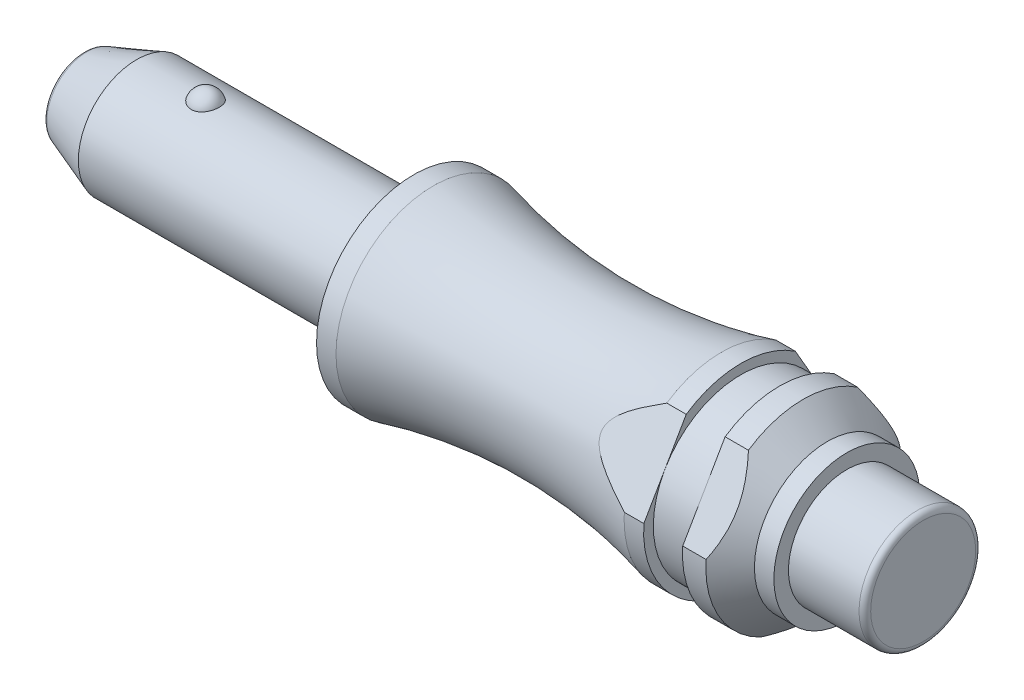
ISO-10303-21;
HEADER;
FILE_DESCRIPTION(('STEP AP214'),'2;1');
FILE_NAME('part.step','',(''),(''),'','','');
FILE_SCHEMA(('AUTOMOTIVE_DESIGN { 1 0 10303 214 1 1 1 1 }'));
ENDSEC;
DATA;
#1=APPLICATION_CONTEXT('core data for automotive mechanical design processes');
#2=APPLICATION_PROTOCOL_DEFINITION('international standard','automotive_design',2000,#1);
#3=PRODUCT_CONTEXT('',#1,'mechanical');
#4=PRODUCT('Part','Part','',(#3));
#5=PRODUCT_RELATED_PRODUCT_CATEGORY('part','',(#4));
#6=PRODUCT_DEFINITION_FORMATION('','',#4);
#7=PRODUCT_DEFINITION_CONTEXT('part definition',#1,'design');
#8=PRODUCT_DEFINITION('design','',#6,#7);
#9=PRODUCT_DEFINITION_SHAPE('','',#8);
#10=(LENGTH_UNIT() NAMED_UNIT(*) SI_UNIT(.MILLI.,.METRE.));
#11=(NAMED_UNIT(*) PLANE_ANGLE_UNIT() SI_UNIT($,.RADIAN.));
#12=(NAMED_UNIT(*) SI_UNIT($,.STERADIAN.) SOLID_ANGLE_UNIT());
#13=UNCERTAINTY_MEASURE_WITH_UNIT(LENGTH_MEASURE(1.E-05),#10,'distance_accuracy_value','');
#14=(GEOMETRIC_REPRESENTATION_CONTEXT(3) GLOBAL_UNCERTAINTY_ASSIGNED_CONTEXT((#13)) GLOBAL_UNIT_ASSIGNED_CONTEXT((#10,
#11,#12)) REPRESENTATION_CONTEXT('',''));
#15=CARTESIAN_POINT('',(0.,0.,0.));
#16=DIRECTION('',(0.,0.,1.));
#17=DIRECTION('',(1.,0.,0.));
#18=AXIS2_PLACEMENT_3D('',#15,#16,#17);
#19=CARTESIAN_POINT('',(21.27,0.,0.));
#20=DIRECTION('',(-1.,0.,0.));
#21=DIRECTION('',(0.,0.,1.));
#22=AXIS2_PLACEMENT_3D('',#19,#20,#21);
#23=CONICAL_SURFACE('',#22,3.75,0.785398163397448);
#24=CARTESIAN_POINT('',(21.27,0.,0.));
#25=DIRECTION('',(-1.,0.,0.));
#26=DIRECTION('',(0.,0.,1.));
#27=AXIS2_PLACEMENT_3D('',#24,#25,#26);
#28=CIRCLE('',#27,3.75);
#29=CARTESIAN_POINT('',(21.27,0.,3.75));
#30=VERTEX_POINT('',#29);
#31=EDGE_CURVE('E217',#30,#30,#28,.T.);
#32=ORIENTED_EDGE('',*,*,#31,.T.);
#33=EDGE_LOOP('',(#32));
#34=FACE_BOUND('',#33,.T.);
#35=CARTESIAN_POINT('',(20.0198,0.362144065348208,4.98706844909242));
#36=CARTESIAN_POINT('',(20.0881871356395,0.498003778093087,4.90862980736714));
#37=CARTESIAN_POINT('',(20.1516487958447,0.635926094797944,4.82900032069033));
#38=CARTESIAN_POINT('',(20.2661228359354,0.916115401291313,4.66723294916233));
#39=CARTESIAN_POINT('',(20.3170901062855,1.05839610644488,4.58508714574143));
#40=CARTESIAN_POINT('',(20.4029683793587,1.34494329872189,4.41964904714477));
#41=CARTESIAN_POINT('',(20.4380521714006,1.4891699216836,4.33637976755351));
#42=CARTESIAN_POINT('',(20.4903967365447,1.7798659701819,4.16854632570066));
#43=CARTESIAN_POINT('',(20.5076837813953,1.92633176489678,4.08398425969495));
#44=CARTESIAN_POINT('',(20.5225741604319,2.21080043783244,3.91974619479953));
#45=CARTESIAN_POINT('',(20.5213453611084,2.34875720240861,3.84009681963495));
#46=CARTESIAN_POINT('',(20.5021251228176,2.62384558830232,3.68127446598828));
#47=CARTESIAN_POINT('',(20.4841252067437,2.76097675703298,3.60210174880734));
#48=CARTESIAN_POINT('',(20.4326988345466,3.03295317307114,3.44507609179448));
#49=CARTESIAN_POINT('',(20.399277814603,3.16779920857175,3.36722269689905));
#50=CARTESIAN_POINT('',(20.3190918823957,3.43448375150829,3.21325230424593));
#51=CARTESIAN_POINT('',(20.2723228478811,3.56632131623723,3.13713585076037));
#52=CARTESIAN_POINT('',(20.1899879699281,3.77124454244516,3.01882337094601));
#53=CARTESIAN_POINT('',(20.1581163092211,3.8454718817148,2.97596819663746));
#54=CARTESIAN_POINT('',(20.091228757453,3.99259539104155,2.89102639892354));
#55=CARTESIAN_POINT('',(20.0562228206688,4.06549494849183,2.84893781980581));
#56=CARTESIAN_POINT('',(20.0198000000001,4.13785593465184,2.80716018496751));
#57=B_SPLINE_CURVE_WITH_KNOTS('',3,(#35,#36,#37,#38,#39,#40,#41,#42,#43,#44,#45,#46,#47,#48,#49,
#50,#51,#52,#53,#54,#55,#56),.UNSPECIFIED.,.F.,.F.,(4,2,2,2,2,2,2,2,2,2,4),(0.,
0.513646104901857,1.02912022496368,1.53884341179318,2.04781305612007,2.52482211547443,
3.00207241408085,3.47915460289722,3.95638428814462,4.23065966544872,4.50409292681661),.UNSPECIFIED.);
#58=CARTESIAN_POINT('',(20.02,0.362541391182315,4.98683905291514));
#59=VERTEX_POINT('',#58);
#60=CARTESIAN_POINT('',(20.02,4.13745860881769,2.80738958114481));
#61=VERTEX_POINT('',#60);
#62=EDGE_CURVE('E310',#59,#61,#57,.T.);
#63=ORIENTED_EDGE('',*,*,#62,.F.);
#64=CARTESIAN_POINT('',(20.02,0.,0.));
#65=DIRECTION('',(-1.,0.,0.));
#66=DIRECTION('',(0.,0.,1.));
#67=AXIS2_PLACEMENT_3D('',#64,#65,#66);
#68=CIRCLE('',#67,5.);
#69=CARTESIAN_POINT('',(20.02,-4.5,2.17944947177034));
#70=VERTEX_POINT('',#69);
#71=EDGE_CURVE('E211',#70,#59,#68,.T.);
#72=ORIENTED_EDGE('',*,*,#71,.F.);
#73=CARTESIAN_POINT('',(18.3556849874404,-4.5,-4.91559707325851));
#74=CARTESIAN_POINT('',(18.4448867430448,-4.5,-4.79463410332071));
#75=CARTESIAN_POINT('',(18.5331473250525,-4.5,-4.67296514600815));
#76=CARTESIAN_POINT('',(18.7073748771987,-4.5,-4.42794865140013));
#77=CARTESIAN_POINT('',(18.7933412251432,-4.5,-4.3046006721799));
#78=CARTESIAN_POINT('',(18.9631764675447,-4.5,-4.05506067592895));
#79=CARTESIAN_POINT('',(19.0470239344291,-4.5,-3.92885402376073));
#80=CARTESIAN_POINT('',(19.2113250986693,-4.5,-3.67425714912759));
#81=CARTESIAN_POINT('',(19.2917790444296,-4.5,-3.54586708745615));
#82=CARTESIAN_POINT('',(19.4525083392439,-4.5,-3.28005050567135));
#83=CARTESIAN_POINT('',(19.5325706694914,-4.5,-3.14249451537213));
#84=CARTESIAN_POINT('',(19.6870571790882,-4.5,-2.86420620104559));
#85=CARTESIAN_POINT('',(19.761480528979,-4.5,-2.72347341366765));
#86=CARTESIAN_POINT('',(19.9030611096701,-4.5,-2.43890359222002));
#87=CARTESIAN_POINT('',(19.9702396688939,-4.5,-2.29507725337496));
#88=CARTESIAN_POINT('',(20.0958295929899,-4.5,-2.0036777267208));
#89=CARTESIAN_POINT('',(20.1542447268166,-4.5,-1.85610618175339));
#90=CARTESIAN_POINT('',(20.2572255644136,-4.5,-1.56568435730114));
#91=CARTESIAN_POINT('',(20.3023943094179,-4.5,-1.4230502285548));
#92=CARTESIAN_POINT('',(20.3812453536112,-4.5,-1.13458124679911));
#93=CARTESIAN_POINT('',(20.414926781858,-4.5,-0.988746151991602));
#94=CARTESIAN_POINT('',(20.4685510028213,-4.5,-0.697049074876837));
#95=CARTESIAN_POINT('',(20.4887137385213,-4.5,-0.551228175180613));
#96=CARTESIAN_POINT('',(20.5149503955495,-4.5,-0.258318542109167));
#97=CARTESIAN_POINT('',(20.5210262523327,-4.5,-0.111229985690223));
#98=CARTESIAN_POINT('',(20.5187227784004,-4.5,0.178573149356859));
#99=CARTESIAN_POINT('',(20.5107563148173,-4.5,0.321291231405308));
#100=CARTESIAN_POINT('',(20.4816637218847,-4.5,0.60537116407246));
#101=CARTESIAN_POINT('',(20.4605362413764,-4.5,0.746732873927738));
#102=CARTESIAN_POINT('',(20.4058673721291,-4.5,1.02946435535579));
#103=CARTESIAN_POINT('',(20.3721233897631,-4.5,1.17079436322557));
#104=CARTESIAN_POINT('',(20.2939407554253,-4.5,1.45040258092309));
#105=CARTESIAN_POINT('',(20.2495032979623,-4.5,1.58868112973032));
#106=CARTESIAN_POINT('',(20.1447753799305,-4.5,1.88122750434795));
#107=CARTESIAN_POINT('',(20.0831341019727,-4.5,2.03500755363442));
#108=CARTESIAN_POINT('',(19.9504854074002,-4.5,2.33850939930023));
#109=CARTESIAN_POINT('',(19.8794734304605,-4.5,2.48822917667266));
#110=CARTESIAN_POINT('',(19.7297832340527,-4.5,2.78437992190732));
#111=CARTESIAN_POINT('',(19.6510803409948,-4.5,2.9307983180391));
#112=CARTESIAN_POINT('',(19.4877586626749,-4.5,3.2202431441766));
#113=CARTESIAN_POINT('',(19.403140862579,-4.5,3.3632701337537));
#114=CARTESIAN_POINT('',(19.2335623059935,-4.5,3.63924449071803));
#115=CARTESIAN_POINT('',(19.1488349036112,-4.5,3.77233600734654));
#116=CARTESIAN_POINT('',(18.9758880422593,-4.5,4.0362379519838));
#117=CARTESIAN_POINT('',(18.8876683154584,-4.5,4.1670482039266));
#118=CARTESIAN_POINT('',(18.7091072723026,-4.5,4.42561343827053));
#119=CARTESIAN_POINT('',(18.6187894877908,-4.5,4.55338472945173));
#120=CARTESIAN_POINT('',(18.4358182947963,-4.5,4.80719276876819));
#121=CARTESIAN_POINT('',(18.343165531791,-4.5,4.93322998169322));
#122=CARTESIAN_POINT('',(18.2495599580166,-4.5,5.05854310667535));
#123=B_SPLINE_CURVE_WITH_KNOTS('',3,(#73,#74,#75,#76,#77,#78,#79,#80,#81,#82,#83,#84,#85,#86,
#87,#88,#89,#90,#91,#92,#93,#94,#95,#96,#97,#98,#99,#100,#101,#102,#103,#104,#105,#106,#107,
#108,#109,#110,#111,#112,#113,#114,#115,#116,#117,#118,#119,#120,#121,#122),.UNSPECIFIED.,.F.,
.F.,(4,2,2,2,2,2,2,2,2,2,2,2,2,2,2,2,2,2,2,2,2,2,2,2,4),(0.,0.450898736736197,0.901918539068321,
1.35643492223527,1.81091797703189,2.28828786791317,2.76572784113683,3.2417214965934,
3.71750984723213,4.16595143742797,4.61442701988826,5.05541657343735,5.49634553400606,
5.9245258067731,6.35275004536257,6.78816856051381,7.22353846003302,7.72016562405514,
8.21703537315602,8.71555503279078,9.2139918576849,9.68724426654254,10.1605330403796,
10.6299139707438,11.0991665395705),.UNSPECIFIED.);
#124=CARTESIAN_POINT('',(20.02,-4.5,-2.17944947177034));
#125=VERTEX_POINT('',#124);
#126=EDGE_CURVE('E255',#125,#70,#123,.T.);
#127=ORIENTED_EDGE('',*,*,#126,.F.);
#128=CARTESIAN_POINT('',(20.02,0.362541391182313,-4.98683905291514));
#129=VERTEX_POINT('',#128);
#130=EDGE_CURVE('E215',#129,#125,#68,.T.);
#131=ORIENTED_EDGE('',*,*,#130,.F.);
#132=CARTESIAN_POINT('',(20.0198,4.13785593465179,-2.80716018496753));
#133=CARTESIAN_POINT('',(20.0881871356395,4.00199622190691,-2.88559882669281));
#134=CARTESIAN_POINT('',(20.1516487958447,3.86407390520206,-2.96522831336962));
#135=CARTESIAN_POINT('',(20.2661228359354,3.58388459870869,-3.12699568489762));
#136=CARTESIAN_POINT('',(20.3170901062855,3.44160389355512,-3.20914148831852));
#137=CARTESIAN_POINT('',(20.4029683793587,3.15505670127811,-3.37457958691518));
#138=CARTESIAN_POINT('',(20.4380521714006,3.0108300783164,-3.45784886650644));
#139=CARTESIAN_POINT('',(20.4903967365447,2.7201340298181,-3.62568230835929));
#140=CARTESIAN_POINT('',(20.5076837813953,2.57366823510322,-3.710244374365));
#141=CARTESIAN_POINT('',(20.5225741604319,2.28919956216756,-3.87448243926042));
#142=CARTESIAN_POINT('',(20.5213453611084,2.15124279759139,-3.954131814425));
#143=CARTESIAN_POINT('',(20.5021251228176,1.87615441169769,-4.11295416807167));
#144=CARTESIAN_POINT('',(20.4841252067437,1.73902324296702,-4.19212688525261));
#145=CARTESIAN_POINT('',(20.4326988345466,1.46704682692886,-4.34915254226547));
#146=CARTESIAN_POINT('',(20.399277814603,1.33220079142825,-4.4270059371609));
#147=CARTESIAN_POINT('',(20.3190918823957,1.06551624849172,-4.58097632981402));
#148=CARTESIAN_POINT('',(20.2723228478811,0.93367868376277,-4.65709278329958));
#149=CARTESIAN_POINT('',(20.1899879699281,0.728755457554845,-4.77540526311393));
#150=CARTESIAN_POINT('',(20.1581163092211,0.654528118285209,-4.81826043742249));
#151=CARTESIAN_POINT('',(20.091228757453,0.507404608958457,-4.90320223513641));
#152=CARTESIAN_POINT('',(20.0562228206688,0.434505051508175,-4.94529081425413));
#153=CARTESIAN_POINT('',(20.0198000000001,0.362144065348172,-4.98706844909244));
#154=B_SPLINE_CURVE_WITH_KNOTS('',3,(#132,#133,#134,#135,#136,#137,#138,#139,#140,#141,#142,
#143,#144,#145,#146,#147,#148,#149,#150,#151,#152,#153),.UNSPECIFIED.,.F.,.F.,(4,2,2,2,2,2,2,2,
2,2,4),(0.,0.51364610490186,1.02912022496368,1.53884341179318,2.04781305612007,2.52482211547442,
3.00207241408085,3.47915460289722,3.95638428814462,4.23065966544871,4.5040929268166),.UNSPECIFIED.);
#155=CARTESIAN_POINT('',(20.02,4.13745860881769,-2.8073895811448));
#156=VERTEX_POINT('',#155);
#157=EDGE_CURVE('E281',#156,#129,#154,.T.);
#158=ORIENTED_EDGE('',*,*,#157,.F.);
#159=EDGE_CURVE('E216',#61,#156,#68,.T.);
#160=ORIENTED_EDGE('',*,*,#159,.F.);
#161=EDGE_LOOP('',(#63,#72,#127,#131,#158,#160));
#162=FACE_BOUND('',#161,.T.);
#163=ADVANCED_FACE('F40',(#34,#162),#23,.T.);
#164=CARTESIAN_POINT('',(0.,0.,0.));
#165=DIRECTION('',(-1.,0.,0.));
#166=DIRECTION('',(0.,0.,1.));
#167=AXIS2_PLACEMENT_3D('',#164,#165,#166);
#168=CYLINDRICAL_SURFACE('',#167,5.);
#169=DIRECTION('',(-1.,0.,0.));
#170=VECTOR('',#169,1.);
#171=CARTESIAN_POINT('',(0.,4.13745860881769,2.80738958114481));
#172=LINE('',#171,#170);
#173=CARTESIAN_POINT('',(18.82,4.13745860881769,2.80738958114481));
#174=VERTEX_POINT('',#173);
#175=EDGE_CURVE('E316',#61,#174,#172,.T.);
#176=ORIENTED_EDGE('',*,*,#175,.F.);
#177=ORIENTED_EDGE('',*,*,#159,.T.);
#178=DIRECTION('',(-1.,0.,0.));
#179=VECTOR('',#178,1.);
#180=CARTESIAN_POINT('',(0.,4.13745860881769,-2.8073895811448));
#181=LINE('',#180,#179);
#182=CARTESIAN_POINT('',(18.82,4.13745860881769,-2.80738958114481));
#183=VERTEX_POINT('',#182);
#184=EDGE_CURVE('E290',#183,#156,#181,.F.);
#185=ORIENTED_EDGE('',*,*,#184,.F.);
#186=CARTESIAN_POINT('',(18.82,0.,0.));
#187=DIRECTION('',(-1.,0.,0.));
#188=DIRECTION('',(0.,0.,1.));
#189=AXIS2_PLACEMENT_3D('',#186,#187,#188);
#190=CIRCLE('',#189,5.);
#191=EDGE_CURVE('E210',#174,#183,#190,.T.);
#192=ORIENTED_EDGE('',*,*,#191,.F.);
#193=EDGE_LOOP('',(#176,#177,#185,#192));
#194=FACE_BOUND('',#193,.T.);
#195=ADVANCED_FACE('F272',(#194),#168,.T.);
#196=DIRECTION('',(-1.,0.,0.));
#197=VECTOR('',#196,1.);
#198=CARTESIAN_POINT('',(0.,0.362541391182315,4.98683905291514));
#199=LINE('',#198,#197);
#200=CARTESIAN_POINT('',(18.82,0.362541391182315,4.98683905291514));
#201=VERTEX_POINT('',#200);
#202=EDGE_CURVE('E307',#201,#59,#199,.F.);
#203=ORIENTED_EDGE('',*,*,#202,.F.);
#204=CARTESIAN_POINT('',(18.82,-4.5,2.17944947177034));
#205=VERTEX_POINT('',#204);
#206=EDGE_CURVE('E204',#205,#201,#190,.T.);
#207=ORIENTED_EDGE('',*,*,#206,.F.);
#208=DIRECTION('',(-1.,0.,0.));
#209=VECTOR('',#208,1.);
#210=CARTESIAN_POINT('',(0.,-4.5,2.17944947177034));
#211=LINE('',#210,#209);
#212=EDGE_CURVE('E264',#70,#205,#211,.T.);
#213=ORIENTED_EDGE('',*,*,#212,.F.);
#214=ORIENTED_EDGE('',*,*,#71,.T.);
#215=EDGE_LOOP('',(#203,#207,#213,#214));
#216=FACE_BOUND('',#215,.T.);
#217=ADVANCED_FACE('F430',(#216),#168,.T.);
#218=DIRECTION('',(-1.,0.,0.));
#219=VECTOR('',#218,1.);
#220=CARTESIAN_POINT('',(0.,0.362541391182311,-4.98683905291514));
#221=LINE('',#220,#219);
#222=CARTESIAN_POINT('',(18.82,0.362541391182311,-4.98683905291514));
#223=VERTEX_POINT('',#222);
#224=EDGE_CURVE('E289',#129,#223,#221,.T.);
#225=ORIENTED_EDGE('',*,*,#224,.F.);
#226=ORIENTED_EDGE('',*,*,#130,.T.);
#227=DIRECTION('',(-1.,0.,0.));
#228=VECTOR('',#227,1.);
#229=CARTESIAN_POINT('',(0.,-4.5,-2.17944947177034));
#230=LINE('',#229,#228);
#231=CARTESIAN_POINT('',(18.82,-4.5,-2.17944947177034));
#232=VERTEX_POINT('',#231);
#233=EDGE_CURVE('E265',#232,#125,#230,.F.);
#234=ORIENTED_EDGE('',*,*,#233,.F.);
#235=EDGE_CURVE('E209',#223,#232,#190,.T.);
#236=ORIENTED_EDGE('',*,*,#235,.F.);
#237=EDGE_LOOP('',(#225,#226,#234,#236));
#238=FACE_BOUND('',#237,.T.);
#239=ADVANCED_FACE('F658',(#238),#168,.T.);
#240=CARTESIAN_POINT('',(18.82,5.,0.));
#241=DIRECTION('',(1.,0.,0.));
#242=DIRECTION('',(0.,0.,-1.));
#243=AXIS2_PLACEMENT_3D('',#240,#241,#242);
#244=PLANE('',#243);
#245=DIRECTION('',(0.,-0.866025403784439,0.5));
#246=VECTOR('',#245,1.);
#247=CARTESIAN_POINT('',(18.82,6.,1.73205080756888));
#248=LINE('',#247,#246);
#249=CARTESIAN_POINT('',(18.82,2.25,3.89711431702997));
#250=VERTEX_POINT('',#249);
#251=EDGE_CURVE('E308',#174,#250,#248,.T.);
#252=ORIENTED_EDGE('',*,*,#251,.F.);
#253=ORIENTED_EDGE('',*,*,#191,.T.);
#254=DIRECTION('',(0.,0.866025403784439,0.5));
#255=VECTOR('',#254,1.);
#256=CARTESIAN_POINT('',(18.82,6.,-1.73205080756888));
#257=LINE('',#256,#255);
#258=CARTESIAN_POINT('',(18.82,2.25,-3.89711431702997));
#259=VERTEX_POINT('',#258);
#260=EDGE_CURVE('E348',#259,#183,#257,.T.);
#261=ORIENTED_EDGE('',*,*,#260,.F.);
#262=CARTESIAN_POINT('',(18.82,0.,0.));
#263=DIRECTION('',(-1.,0.,0.));
#264=DIRECTION('',(0.,0.,1.));
#265=AXIS2_PLACEMENT_3D('',#262,#263,#264);
#266=CIRCLE('',#265,4.5);
#267=EDGE_CURVE('E200',#250,#259,#266,.T.);
#268=ORIENTED_EDGE('',*,*,#267,.F.);
#269=EDGE_LOOP('',(#252,#253,#261,#268));
#270=FACE_BOUND('',#269,.T.);
#271=ADVANCED_FACE('F347',(#270),#244,.F.);
#272=EDGE_CURVE('E304',#250,#201,#248,.T.);
#273=ORIENTED_EDGE('',*,*,#272,.F.);
#274=CARTESIAN_POINT('',(18.82,-4.5,0.));
#275=VERTEX_POINT('',#274);
#276=EDGE_CURVE('E197',#275,#250,#266,.T.);
#277=ORIENTED_EDGE('',*,*,#276,.F.);
#278=DIRECTION('',(0.,0.,-1.));
#279=VECTOR('',#278,1.);
#280=CARTESIAN_POINT('',(18.82,-4.5,0.));
#281=LINE('',#280,#279);
#282=EDGE_CURVE('E56',#205,#275,#281,.T.);
#283=ORIENTED_EDGE('',*,*,#282,.F.);
#284=ORIENTED_EDGE('',*,*,#206,.T.);
#285=EDGE_LOOP('',(#273,#277,#283,#284));
#286=FACE_BOUND('',#285,.T.);
#287=ADVANCED_FACE('F340',(#286),#244,.F.);
#288=EDGE_CURVE('E64',#223,#259,#257,.T.);
#289=ORIENTED_EDGE('',*,*,#288,.F.);
#290=ORIENTED_EDGE('',*,*,#235,.T.);
#291=EDGE_CURVE('E356',#275,#232,#281,.T.);
#292=ORIENTED_EDGE('',*,*,#291,.F.);
#293=EDGE_CURVE('E205',#259,#275,#266,.T.);
#294=ORIENTED_EDGE('',*,*,#293,.F.);
#295=EDGE_LOOP('',(#289,#290,#292,#294));
#296=FACE_BOUND('',#295,.T.);
#297=ADVANCED_FACE('F353',(#296),#244,.F.);
#298=CARTESIAN_POINT('',(16.82,4.5,0.));
#299=DIRECTION('',(-1.,0.,0.));
#300=DIRECTION('',(0.,0.,1.));
#301=AXIS2_PLACEMENT_3D('',#298,#299,#300);
#302=PLANE('',#301);
#303=DIRECTION('',(0.,0.866025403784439,-0.5));
#304=VECTOR('',#303,1.);
#305=CARTESIAN_POINT('',(16.82,5.625,1.94855715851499));
#306=LINE('',#305,#304);
#307=CARTESIAN_POINT('',(16.82,0.362541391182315,4.98683905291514));
#308=VERTEX_POINT('',#307);
#309=CARTESIAN_POINT('',(16.82,2.25,3.89711431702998));
#310=VERTEX_POINT('',#309);
#311=EDGE_CURVE('E303',#308,#310,#306,.T.);
#312=ORIENTED_EDGE('',*,*,#311,.F.);
#313=CARTESIAN_POINT('',(16.82,0.,0.));
#314=DIRECTION('',(-1.,0.,0.));
#315=DIRECTION('',(0.,0.,1.));
#316=AXIS2_PLACEMENT_3D('',#313,#314,#315);
#317=CIRCLE('',#316,5.);
#318=CARTESIAN_POINT('',(16.82,-4.5,2.17944947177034));
#319=VERTEX_POINT('',#318);
#320=EDGE_CURVE('E184',#319,#308,#317,.T.);
#321=ORIENTED_EDGE('',*,*,#320,.F.);
#322=DIRECTION('',(0.,0.,1.));
#323=VECTOR('',#322,1.);
#324=CARTESIAN_POINT('',(16.82,-4.5,0.));
#325=LINE('',#324,#323);
#326=CARTESIAN_POINT('',(16.82,-4.5,0.));
#327=VERTEX_POINT('',#326);
#328=EDGE_CURVE('E389',#327,#319,#325,.T.);
#329=ORIENTED_EDGE('',*,*,#328,.F.);
#330=CARTESIAN_POINT('',(16.82,0.,0.));
#331=DIRECTION('',(-1.,0.,0.));
#332=DIRECTION('',(0.,0.,1.));
#333=AXIS2_PLACEMENT_3D('',#330,#331,#332);
#334=CIRCLE('',#333,4.5);
#335=EDGE_CURVE('E199',#327,#310,#334,.T.);
#336=ORIENTED_EDGE('',*,*,#335,.T.);
#337=EDGE_LOOP('',(#312,#321,#329,#336));
#338=FACE_BOUND('',#337,.T.);
#339=ADVANCED_FACE('F414',(#338),#302,.F.);
#340=CARTESIAN_POINT('',(16.82,4.13745860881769,2.80738958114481));
#341=VERTEX_POINT('',#340);
#342=EDGE_CURVE('E300',#310,#341,#306,.T.);
#343=ORIENTED_EDGE('',*,*,#342,.F.);
#344=CARTESIAN_POINT('',(16.82,2.25,-3.89711431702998));
#345=VERTEX_POINT('',#344);
#346=EDGE_CURVE('E194',#310,#345,#334,.T.);
#347=ORIENTED_EDGE('',*,*,#346,.T.);
#348=DIRECTION('',(0.,-0.866025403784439,-0.5));
#349=VECTOR('',#348,1.);
#350=CARTESIAN_POINT('',(16.82,5.625,-1.94855715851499));
#351=LINE('',#350,#349);
#352=CARTESIAN_POINT('',(16.82,4.13745860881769,-2.8073895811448));
#353=VERTEX_POINT('',#352);
#354=EDGE_CURVE('E351',#353,#345,#351,.T.);
#355=ORIENTED_EDGE('',*,*,#354,.F.);
#356=EDGE_CURVE('E193',#341,#353,#317,.T.);
#357=ORIENTED_EDGE('',*,*,#356,.F.);
#358=EDGE_LOOP('',(#343,#347,#355,#357));
#359=FACE_BOUND('',#358,.T.);
#360=ADVANCED_FACE('F406',(#359),#302,.F.);
#361=CARTESIAN_POINT('',(16.82,0.362541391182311,-4.98683905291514));
#362=VERTEX_POINT('',#361);
#363=EDGE_CURVE('E379',#345,#362,#351,.T.);
#364=ORIENTED_EDGE('',*,*,#363,.F.);
#365=EDGE_CURVE('E198',#345,#327,#334,.T.);
#366=ORIENTED_EDGE('',*,*,#365,.T.);
#367=CARTESIAN_POINT('',(16.82,-4.5,-2.17944947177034));
#368=VERTEX_POINT('',#367);
#369=EDGE_CURVE('E399',#368,#327,#325,.T.);
#370=ORIENTED_EDGE('',*,*,#369,.F.);
#371=EDGE_CURVE('E169',#362,#368,#317,.T.);
#372=ORIENTED_EDGE('',*,*,#371,.F.);
#373=EDGE_LOOP('',(#364,#366,#370,#372));
#374=FACE_BOUND('',#373,.T.);
#375=ADVANCED_FACE('F398',(#374),#302,.F.);
#376=CARTESIAN_POINT('',(0.,0.,0.));
#377=DIRECTION('',(-1.,0.,0.));
#378=DIRECTION('',(0.,0.,1.));
#379=AXIS2_PLACEMENT_3D('',#376,#377,#378);
#380=CYLINDRICAL_SURFACE('',#379,5.);
#381=DIRECTION('',(-1.,0.,0.));
#382=VECTOR('',#381,1.);
#383=CARTESIAN_POINT('',(0.,4.13745860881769,2.80738958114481));
#384=LINE('',#383,#382);
#385=CARTESIAN_POINT('',(15.82,4.13745860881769,2.80738958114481));
#386=VERTEX_POINT('',#385);
#387=EDGE_CURVE('E297',#341,#386,#384,.T.);
#388=ORIENTED_EDGE('',*,*,#387,.F.);
#389=ORIENTED_EDGE('',*,*,#356,.T.);
#390=DIRECTION('',(-1.,0.,0.));
#391=VECTOR('',#390,1.);
#392=CARTESIAN_POINT('',(0.,4.13745860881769,-2.8073895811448));
#393=LINE('',#392,#391);
#394=CARTESIAN_POINT('',(15.82,4.13745860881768,-2.80738958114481));
#395=VERTEX_POINT('',#394);
#396=EDGE_CURVE('E360',#395,#353,#393,.F.);
#397=ORIENTED_EDGE('',*,*,#396,.F.);
#398=CARTESIAN_POINT('',(15.82,0.,0.));
#399=DIRECTION('',(-1.,0.,0.));
#400=DIRECTION('',(0.,0.,1.));
#401=AXIS2_PLACEMENT_3D('',#398,#399,#400);
#402=CIRCLE('',#401,5.);
#403=EDGE_CURVE('E178',#386,#395,#402,.T.);
#404=ORIENTED_EDGE('',*,*,#403,.F.);
#405=EDGE_LOOP('',(#388,#389,#397,#404));
#406=FACE_BOUND('',#405,.T.);
#407=ADVANCED_FACE('F517',(#406),#380,.T.);
#408=DIRECTION('',(-1.,0.,0.));
#409=VECTOR('',#408,1.);
#410=CARTESIAN_POINT('',(0.,0.362541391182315,4.98683905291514));
#411=LINE('',#410,#409);
#412=CARTESIAN_POINT('',(15.82,0.362541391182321,4.98683905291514));
#413=VERTEX_POINT('',#412);
#414=EDGE_CURVE('E294',#413,#308,#411,.F.);
#415=ORIENTED_EDGE('',*,*,#414,.F.);
#416=CARTESIAN_POINT('',(15.82,-4.49999999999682,2.1794494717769));
#417=VERTEX_POINT('',#416);
#418=EDGE_CURVE('E179',#417,#413,#402,.T.);
#419=ORIENTED_EDGE('',*,*,#418,.F.);
#420=DIRECTION('',(-1.,0.,0.));
#421=VECTOR('',#420,1.);
#422=CARTESIAN_POINT('',(0.,-4.5,2.17944947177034));
#423=LINE('',#422,#421);
#424=EDGE_CURVE('E153',#319,#417,#423,.T.);
#425=ORIENTED_EDGE('',*,*,#424,.F.);
#426=ORIENTED_EDGE('',*,*,#320,.T.);
#427=EDGE_LOOP('',(#415,#419,#425,#426));
#428=FACE_BOUND('',#427,.T.);
#429=ADVANCED_FACE('F516',(#428),#380,.T.);
#430=DIRECTION('',(-1.,0.,0.));
#431=VECTOR('',#430,1.);
#432=CARTESIAN_POINT('',(0.,0.362541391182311,-4.98683905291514));
#433=LINE('',#432,#431);
#434=CARTESIAN_POINT('',(15.82,0.362541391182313,-4.98683905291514));
#435=VERTEX_POINT('',#434);
#436=EDGE_CURVE('E377',#362,#435,#433,.T.);
#437=ORIENTED_EDGE('',*,*,#436,.F.);
#438=ORIENTED_EDGE('',*,*,#371,.T.);
#439=DIRECTION('',(-1.,0.,0.));
#440=VECTOR('',#439,1.);
#441=CARTESIAN_POINT('',(0.,-4.5,-2.17944947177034));
#442=LINE('',#441,#440);
#443=CARTESIAN_POINT('',(15.82,-4.5,-2.17944947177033));
#444=VERTEX_POINT('',#443);
#445=EDGE_CURVE('E150',#444,#368,#442,.F.);
#446=ORIENTED_EDGE('',*,*,#445,.F.);
#447=EDGE_CURVE('E167',#435,#444,#402,.T.);
#448=ORIENTED_EDGE('',*,*,#447,.F.);
#449=EDGE_LOOP('',(#437,#438,#446,#448));
#450=FACE_BOUND('',#449,.T.);
#451=ADVANCED_FACE('F166',(#450),#380,.T.);
#452=CARTESIAN_POINT('',(8.41,0.,0.));
#453=DIRECTION('',(-1.,0.,0.));
#454=DIRECTION('',(0.,0.,1.));
#455=AXIS2_PLACEMENT_3D('',#452,#453,#454);
#456=TOROIDAL_SURFACE('',#455,33.4239999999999,29.3739999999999);
#457=CARTESIAN_POINT('',(1.,0.,0.));
#458=DIRECTION('',(-1.,0.,0.));
#459=DIRECTION('',(0.,0.,1.));
#460=AXIS2_PLACEMENT_3D('',#457,#458,#459);
#461=CIRCLE('',#460,5.);
#462=CARTESIAN_POINT('',(1.,0.,5.));
#463=VERTEX_POINT('',#462);
#464=EDGE_CURVE('E186',#463,#463,#461,.T.);
#465=ORIENTED_EDGE('',*,*,#464,.F.);
#466=EDGE_LOOP('',(#465));
#467=FACE_BOUND('',#466,.T.);
#468=CARTESIAN_POINT('',(15.8202,4.13756219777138,2.80732977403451));
#469=CARTESIAN_POINT('',(15.6935037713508,4.07185115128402,2.84526806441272));
#470=CARTESIAN_POINT('',(15.5671918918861,4.00553267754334,2.88355705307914));
#471=CARTESIAN_POINT('',(15.3157592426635,3.87052087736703,2.96150615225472));
#472=CARTESIAN_POINT('',(15.1906431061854,3.80182110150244,3.0011699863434));
#473=CARTESIAN_POINT('',(14.9328762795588,3.65564587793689,3.08556429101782));
#474=CARTESIAN_POINT('',(14.8004228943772,3.57790793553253,3.13044631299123));
#475=CARTESIAN_POINT('',(14.5403473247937,3.41678440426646,3.22347102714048));
#476=CARTESIAN_POINT('',(14.4127178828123,3.33340787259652,3.27160849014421));
#477=CARTESIAN_POINT('',(14.2288402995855,3.20189554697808,3.34753716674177));
#478=CARTESIAN_POINT('',(14.1692131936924,3.1573282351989,3.37326811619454));
#479=CARTESIAN_POINT('',(14.0531615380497,3.06519102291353,3.42646356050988));
#480=CARTESIAN_POINT('',(13.9967348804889,3.0176231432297,3.45392688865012));
#481=CARTESIAN_POINT('',(13.8895717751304,2.9194058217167,3.51063268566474));
#482=CARTESIAN_POINT('',(13.8387533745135,2.86882443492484,3.539835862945));
#483=CARTESIAN_POINT('',(13.7444255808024,2.76285978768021,3.60101458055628));
#484=CARTESIAN_POINT('',(13.7008927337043,2.70749284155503,3.63298070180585));
#485=CARTESIAN_POINT('',(13.635893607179,2.60707036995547,3.69095964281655));
#486=CARTESIAN_POINT('',(13.6116534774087,2.56339026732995,3.71617836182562));
#487=CARTESIAN_POINT('',(13.5717631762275,2.47317843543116,3.76826218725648));
#488=CARTESIAN_POINT('',(13.5560918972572,2.42665403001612,3.79512306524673));
#489=CARTESIAN_POINT('',(13.537429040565,2.34005411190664,3.84512155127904));
#490=CARTESIAN_POINT('',(13.5327069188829,2.30026336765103,3.86809474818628));
#491=CARTESIAN_POINT('',(13.5313213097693,2.22055507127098,3.91411435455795));
#492=CARTESIAN_POINT('',(13.5346605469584,2.18063748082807,3.93716078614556));
#493=CARTESIAN_POINT('',(13.5489188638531,2.1020409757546,3.98253849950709));
#494=CARTESIAN_POINT('',(13.5598057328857,2.06335752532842,4.00487240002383));
#495=CARTESIAN_POINT('',(13.5878869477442,1.98780470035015,4.04849284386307));
#496=CARTESIAN_POINT('',(13.6050817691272,1.9509354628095,4.06977930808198));
#497=CARTESIAN_POINT('',(13.6600814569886,1.85055087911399,4.12773637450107));
#498=CARTESIAN_POINT('',(13.7033715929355,1.78930596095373,4.16309614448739));
#499=CARTESIAN_POINT('',(13.7755687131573,1.70170478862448,4.21367270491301));
#500=CARTESIAN_POINT('',(13.8010348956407,1.67304301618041,4.23022058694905));
#501=CARTESIAN_POINT('',(13.8538675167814,1.61707483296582,4.26253383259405));
#502=CARTESIAN_POINT('',(13.8812328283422,1.58976763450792,4.27829965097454));
#503=CARTESIAN_POINT('',(13.979700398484,1.4961167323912,4.33236902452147));
#504=CARTESIAN_POINT('',(14.0546708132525,1.43284422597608,4.36889942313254));
#505=CARTESIAN_POINT('',(14.2099302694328,1.3113495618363,4.43904440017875));
#506=CARTESIAN_POINT('',(14.2902277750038,1.25313579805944,4.47265413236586));
#507=CARTESIAN_POINT('',(14.4546717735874,1.13999189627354,4.53797779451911));
#508=CARTESIAN_POINT('',(14.538839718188,1.08508531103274,4.56967812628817));
#509=CARTESIAN_POINT('',(14.7094148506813,0.977941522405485,4.63153762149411));
#510=CARTESIAN_POINT('',(14.795822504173,0.925704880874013,4.66169646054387));
#511=CARTESIAN_POINT('',(14.9599582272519,0.82922435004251,4.717399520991));
#512=CARTESIAN_POINT('',(15.0375156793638,0.78476158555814,4.74307011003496));
#513=CARTESIAN_POINT('',(15.1935413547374,0.697025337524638,4.79372465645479));
#514=CARTESIAN_POINT('',(15.2720097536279,0.653752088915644,4.81870847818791));
#515=CARTESIAN_POINT('',(15.4285030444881,0.568741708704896,4.86778924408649));
#516=CARTESIAN_POINT('',(15.5065184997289,0.526991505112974,4.89189373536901));
#517=CARTESIAN_POINT('',(15.6630299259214,0.444219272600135,4.93968230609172));
#518=CARTESIAN_POINT('',(15.7415257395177,0.403197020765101,4.96336651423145));
#519=CARTESIAN_POINT('',(15.8202,0.362437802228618,4.98689886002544));
#520=B_SPLINE_CURVE_WITH_KNOTS('',3,(#468,#469,#470,#471,#472,#473,#474,#475,#476,#477,#478,
#479,#480,#481,#482,#483,#484,#485,#486,#487,#488,#489,#490,#491,#492,#493,#494,#495,#496,#497,
#498,#499,#500,#501,#502,#503,#504,#505,#506,#507,#508,#509,#510,#511,#512,#513,#514,#515,#516,
#517,#518,#519),.UNSPECIFIED.,.F.,.F.,(4,2,2,2,2,2,2,2,2,2,2,2,2,2,2,2,2,2,2,2,2,2,2,2,2,4),(0.,
0.443084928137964,0.887481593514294,1.36740598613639,1.84657699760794,2.08277252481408,
2.31881064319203,2.5507399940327,2.78190771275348,2.94923044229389,3.11613912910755,
3.25403480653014,3.3919770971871,3.52933429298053,3.66670184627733,3.91392521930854,
4.03917953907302,4.16436014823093,4.4778495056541,4.7918494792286,5.1078709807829,
5.4239587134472,5.70297413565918,5.98204427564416,6.25716538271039,6.53220073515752),.UNSPECIFIED.);
#521=EDGE_CURVE('E375',#386,#413,#520,.T.);
#522=ORIENTED_EDGE('',*,*,#521,.F.);
#523=ORIENTED_EDGE('',*,*,#403,.T.);
#524=CARTESIAN_POINT('',(15.8202000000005,0.362437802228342,-4.9868988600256));
#525=CARTESIAN_POINT('',(15.6935037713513,0.428148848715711,-4.94896056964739));
#526=CARTESIAN_POINT('',(15.5671918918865,0.494467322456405,-4.91067158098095));
#527=CARTESIAN_POINT('',(15.3157592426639,0.629479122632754,-4.83272248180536));
#528=CARTESIAN_POINT('',(15.1906431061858,0.698178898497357,-4.79305864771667));
#529=CARTESIAN_POINT('',(14.9328762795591,0.844354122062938,-4.70866434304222));
#530=CARTESIAN_POINT('',(14.8004228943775,0.922092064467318,-4.66378232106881));
#531=CARTESIAN_POINT('',(14.5403473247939,1.08321559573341,-4.57075760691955));
#532=CARTESIAN_POINT('',(14.4127178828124,1.16659212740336,-4.5226201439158));
#533=CARTESIAN_POINT('',(14.2288402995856,1.29810445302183,-4.44669146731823));
#534=CARTESIAN_POINT('',(14.1692131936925,1.34267176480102,-4.42096051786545));
#535=CARTESIAN_POINT('',(14.0531615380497,1.43480897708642,-4.3677650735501));
#536=CARTESIAN_POINT('',(13.9967348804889,1.48237685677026,-4.34030174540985));
#537=CARTESIAN_POINT('',(13.8895717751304,1.58059417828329,-4.28359594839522));
#538=CARTESIAN_POINT('',(13.8387533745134,1.63117556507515,-4.25439277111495));
#539=CARTESIAN_POINT('',(13.7444255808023,1.73714021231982,-4.19321405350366));
#540=CARTESIAN_POINT('',(13.7008927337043,1.79250715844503,-4.16124793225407));
#541=CARTESIAN_POINT('',(13.6358936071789,1.89292963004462,-4.10326899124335));
#542=CARTESIAN_POINT('',(13.6116534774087,1.93660973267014,-4.07805027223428));
#543=CARTESIAN_POINT('',(13.5717631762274,2.02682156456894,-4.02596644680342));
#544=CARTESIAN_POINT('',(13.5560918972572,2.07334596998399,-3.99910556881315));
#545=CARTESIAN_POINT('',(13.537429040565,2.15994588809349,-3.94910708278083));
#546=CARTESIAN_POINT('',(13.5327069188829,2.1997366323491,-3.9261338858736));
#547=CARTESIAN_POINT('',(13.5313213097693,2.27944492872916,-3.88011427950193));
#548=CARTESIAN_POINT('',(13.5346605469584,2.31936251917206,-3.85706784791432));
#549=CARTESIAN_POINT('',(13.5489188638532,2.39795902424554,-3.81169013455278));
#550=CARTESIAN_POINT('',(13.5598057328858,2.43664247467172,-3.78935623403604));
#551=CARTESIAN_POINT('',(13.5878869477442,2.51219529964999,-3.74573579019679));
#552=CARTESIAN_POINT('',(13.6050817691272,2.54906453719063,-3.72444932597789));
#553=CARTESIAN_POINT('',(13.6600814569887,2.64944912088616,-3.66649225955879));
#554=CARTESIAN_POINT('',(13.7033715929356,2.71069403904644,-3.63113248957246));
#555=CARTESIAN_POINT('',(13.7755687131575,2.79829521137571,-3.58055592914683));
#556=CARTESIAN_POINT('',(13.8010348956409,2.82695698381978,-3.56400804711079));
#557=CARTESIAN_POINT('',(13.8538675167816,2.88292516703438,-3.53169480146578));
#558=CARTESIAN_POINT('',(13.8812328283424,2.91023236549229,-3.51592898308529));
#559=CARTESIAN_POINT('',(13.9797003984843,3.00388326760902,-3.46185960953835));
#560=CARTESIAN_POINT('',(14.0546708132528,3.06715577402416,-3.42532921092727));
#561=CARTESIAN_POINT('',(14.2099302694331,3.18865043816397,-3.35518423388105));
#562=CARTESIAN_POINT('',(14.2902277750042,3.24686420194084,-3.32157450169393));
#563=CARTESIAN_POINT('',(14.4546717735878,3.36000810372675,-3.25625083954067));
#564=CARTESIAN_POINT('',(14.5388397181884,3.41491468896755,-3.22455050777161));
#565=CARTESIAN_POINT('',(14.7094148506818,3.52205847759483,-3.16269101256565));
#566=CARTESIAN_POINT('',(14.7958225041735,3.57429511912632,-3.13253217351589));
#567=CARTESIAN_POINT('',(14.9599582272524,3.67077564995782,-3.07682911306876));
#568=CARTESIAN_POINT('',(15.0375156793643,3.71523841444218,-3.0511585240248));
#569=CARTESIAN_POINT('',(15.193541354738,3.80297466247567,-3.00050397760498));
#570=CARTESIAN_POINT('',(15.2720097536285,3.84624791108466,-2.97552015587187));
#571=CARTESIAN_POINT('',(15.4285030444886,3.9312582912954,-2.92643938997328));
#572=CARTESIAN_POINT('',(15.5065184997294,3.97300849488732,-2.90233489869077));
#573=CARTESIAN_POINT('',(15.6630299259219,4.05578072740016,-2.85454632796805));
#574=CARTESIAN_POINT('',(15.7415257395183,4.0968029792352,-2.83086211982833));
#575=CARTESIAN_POINT('',(15.8202000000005,4.13756219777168,-2.80732977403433));
#576=B_SPLINE_CURVE_WITH_KNOTS('',3,(#524,#525,#526,#527,#528,#529,#530,#531,#532,#533,#534,
#535,#536,#537,#538,#539,#540,#541,#542,#543,#544,#545,#546,#547,#548,#549,#550,#551,#552,#553,
#554,#555,#556,#557,#558,#559,#560,#561,#562,#563,#564,#565,#566,#567,#568,#569,#570,#571,#572,
#573,#574,#575),.UNSPECIFIED.,.F.,.F.,(4,2,2,2,2,2,2,2,2,2,2,2,2,2,2,2,2,2,2,2,2,2,2,2,2,4),(0.,
0.443084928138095,0.887481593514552,1.36740598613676,1.84657699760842,2.08277252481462,
2.31881064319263,2.55073999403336,2.78190771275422,2.94923044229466,3.11613912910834,
3.25403480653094,3.39197709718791,3.52933429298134,3.66670184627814,3.91392521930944,
4.03917953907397,4.16436014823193,4.47784950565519,4.79184947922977,5.10787098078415,
5.42395871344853,5.7029741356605,5.98204427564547,6.25716538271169,6.53220073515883),.UNSPECIFIED.);
#577=EDGE_CURVE('E159',#435,#395,#576,.T.);
#578=ORIENTED_EDGE('',*,*,#577,.F.);
#579=ORIENTED_EDGE('',*,*,#447,.T.);
#580=CARTESIAN_POINT('',(13.5319234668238,-4.5,0.));
#581=CARTESIAN_POINT('',(13.5319346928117,-4.5,-0.0505291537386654));
#582=CARTESIAN_POINT('',(13.5368088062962,-4.5,-0.10111495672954));
#583=CARTESIAN_POINT('',(13.5555488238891,-4.5,-0.200602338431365));
#584=CARTESIAN_POINT('',(13.5694348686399,-4.5,-0.249499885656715));
#585=CARTESIAN_POINT('',(13.6110811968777,-4.5,-0.362726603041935));
#586=CARTESIAN_POINT('',(13.642113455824,-4.5,-0.425826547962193));
#587=CARTESIAN_POINT('',(13.713274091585,-4.5,-0.546631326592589));
#588=CARTESIAN_POINT('',(13.7534295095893,-4.5,-0.604319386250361));
#589=CARTESIAN_POINT('',(13.8576874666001,-4.5,-0.738424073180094));
#590=CARTESIAN_POINT('',(13.9247522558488,-4.5,-0.812493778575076));
#591=CARTESIAN_POINT('',(14.0655706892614,-4.5,-0.954069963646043));
#592=CARTESIAN_POINT('',(14.1393405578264,-4.5,-1.02155965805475));
#593=CARTESIAN_POINT('',(14.2914592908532,-4.5,-1.15220134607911));
#594=CARTESIAN_POINT('',(14.3698359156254,-4.5,-1.215320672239));
#595=CARTESIAN_POINT('',(14.5291654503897,-4.5,-1.33796151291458));
#596=CARTESIAN_POINT('',(14.6101150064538,-4.5,-1.39748743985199));
#597=CARTESIAN_POINT('',(14.7844173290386,-4.5,-1.52146814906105));
#598=CARTESIAN_POINT('',(14.8780219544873,-4.5,-1.58556686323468));
#599=CARTESIAN_POINT('',(15.0668321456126,-4.5,-1.71136978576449));
#600=CARTESIAN_POINT('',(15.1620379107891,-4.5,-1.77307369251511));
#601=CARTESIAN_POINT('',(15.4493883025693,-4.5,-1.95563042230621));
#602=CARTESIAN_POINT('',(15.6431850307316,-4.5,-2.0738725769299));
#603=CARTESIAN_POINT('',(16.0333081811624,-4.5,-2.30683659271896));
#604=CARTESIAN_POINT('',(16.229638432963,-4.5,-2.42155193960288));
#605=CARTESIAN_POINT('',(16.6233323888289,-4.5,-2.64907634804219));
#606=CARTESIAN_POINT('',(16.8206958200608,-4.5,-2.76188588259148));
#607=CARTESIAN_POINT('',(17.2153218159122,-4.5,-2.9865838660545));
#608=CARTESIAN_POINT('',(17.4125835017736,-4.5,-3.09847386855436));
#609=CARTESIAN_POINT('',(17.8070130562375,-4.5,-3.32244376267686));
#610=CARTESIAN_POINT('',(18.0041809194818,-4.5,-3.43452366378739));
#611=CARTESIAN_POINT('',(18.3979288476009,-4.5,-3.65939984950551));
#612=CARTESIAN_POINT('',(18.5945092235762,-4.5,-3.77219558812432));
#613=CARTESIAN_POINT('',(18.9869516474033,-4.5,-3.99904091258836));
#614=CARTESIAN_POINT('',(19.1828136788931,-4.5,-4.11309052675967));
#615=CARTESIAN_POINT('',(19.6493782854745,-4.5,-4.38735689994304));
#616=CARTESIAN_POINT('',(19.9196425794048,-4.5,-4.54832220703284));
#617=CARTESIAN_POINT('',(20.4578365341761,-4.5,-4.87409656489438));
#618=CARTESIAN_POINT('',(20.725766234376,-4.5,-5.03890555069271));
#619=CARTESIAN_POINT('',(21.5254170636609,-4.5,-5.53997762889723));
#620=CARTESIAN_POINT('',(22.0530102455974,-4.5,-5.88289184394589));
#621=CARTESIAN_POINT('',(23.0942617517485,-4.5,-6.58959329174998));
#622=CARTESIAN_POINT('',(23.607916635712,-4.5,-6.95338560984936));
#623=CARTESIAN_POINT('',(24.6184684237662,-4.5,-7.70353254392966));
#624=CARTESIAN_POINT('',(25.1153666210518,-4.5,-8.0898854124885));
#625=CARTESIAN_POINT('',(26.0898897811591,-4.5,-8.88610866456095));
#626=CARTESIAN_POINT('',(26.567517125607,-4.5,-9.29597612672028));
#627=CARTESIAN_POINT('',(27.5012155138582,-4.5,-10.1396287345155));
#628=CARTESIAN_POINT('',(27.9572860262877,-4.5,-10.5734144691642));
#629=CARTESIAN_POINT('',(28.8455681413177,-4.5,-11.4647016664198));
#630=CARTESIAN_POINT('',(29.277782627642,-4.5,-11.9222002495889));
#631=CARTESIAN_POINT('',(30.1162254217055,-4.5,-12.8603159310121));
#632=CARTESIAN_POINT('',(30.5224564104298,-4.5,-13.3409306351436));
#633=CARTESIAN_POINT('',(31.4657402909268,-4.5,-14.52348000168));
#634=CARTESIAN_POINT('',(31.9892502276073,-4.5,-15.2363063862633));
#635=CARTESIAN_POINT('',(32.975917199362,-4.5,-16.702289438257));
#636=CARTESIAN_POINT('',(33.4390899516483,-4.5,-17.4554355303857));
#637=CARTESIAN_POINT('',(34.3007607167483,-4.5,-18.9978800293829));
#638=CARTESIAN_POINT('',(34.6992612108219,-4.5,-19.7871770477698));
#639=CARTESIAN_POINT('',(35.427701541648,-4.5,-21.3968941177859));
#640=CARTESIAN_POINT('',(35.7576364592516,-4.5,-22.2173163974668));
#641=CARTESIAN_POINT('',(36.3462705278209,-4.5,-23.8853858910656));
#642=CARTESIAN_POINT('',(36.6048115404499,-4.5,-24.7330889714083));
#643=CARTESIAN_POINT('',(37.047038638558,-4.5,-26.4478133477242));
#644=CARTESIAN_POINT('',(37.2307252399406,-4.5,-27.3148345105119));
#645=CARTESIAN_POINT('',(37.5212698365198,-4.5,-29.0616651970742));
#646=CARTESIAN_POINT('',(37.6281280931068,-4.5,-29.9414746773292));
#647=CARTESIAN_POINT('',(37.763723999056,-4.5,-31.7070909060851));
#648=CARTESIAN_POINT('',(37.7924638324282,-4.5,-32.592897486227));
#649=CARTESIAN_POINT('',(37.7716477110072,-4.5,-34.3293940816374));
#650=CARTESIAN_POINT('',(37.725068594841,-4.5,-35.1801208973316));
#651=CARTESIAN_POINT('',(37.559239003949,-4.5,-36.8744561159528));
#652=CARTESIAN_POINT('',(37.4399904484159,-4.5,-37.7180647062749));
#653=CARTESIAN_POINT('',(37.1295015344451,-4.5,-39.3918331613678));
#654=CARTESIAN_POINT('',(36.9382691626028,-4.5,-40.2219945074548));
#655=CARTESIAN_POINT('',(36.4850505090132,-4.5,-41.8627776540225));
#656=CARTESIAN_POINT('',(36.2230647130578,-4.5,-42.6733995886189));
#657=CARTESIAN_POINT('',(35.635559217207,-4.5,-44.2544664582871));
#658=CARTESIAN_POINT('',(35.3112850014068,-4.5,-45.0253744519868));
#659=CARTESIAN_POINT('',(34.5985127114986,-4.5,-46.5369007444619));
#660=CARTESIAN_POINT('',(34.2100155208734,-4.5,-47.2775194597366));
#661=CARTESIAN_POINT('',(33.371529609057,-4.5,-48.7230501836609));
#662=CARTESIAN_POINT('',(32.9215433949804,-4.5,-49.4279636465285));
#663=CARTESIAN_POINT('',(31.9632525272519,-4.5,-50.7969712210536));
#664=CARTESIAN_POINT('',(31.4549480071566,-4.5,-51.4610654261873));
#665=CARTESIAN_POINT('',(30.3878941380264,-4.5,-52.7384977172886));
#666=CARTESIAN_POINT('',(29.8295756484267,-4.5,-53.3521957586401));
#667=CARTESIAN_POINT('',(28.6630667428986,-4.5,-54.5302045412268));
#668=CARTESIAN_POINT('',(28.0548766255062,-4.5,-55.094515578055));
#669=CARTESIAN_POINT('',(26.792955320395,-4.5,-56.1696673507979));
#670=CARTESIAN_POINT('',(26.1392248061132,-4.5,-56.6805088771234));
#671=CARTESIAN_POINT('',(24.7908769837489,-4.5,-57.6450365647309));
#672=CARTESIAN_POINT('',(24.0962597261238,-4.5,-58.0987227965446));
#673=CARTESIAN_POINT('',(22.6738250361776,-4.5,-58.9440401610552));
#674=CARTESIAN_POINT('',(21.9461442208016,-4.5,-59.3359012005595));
#675=CARTESIAN_POINT('',(20.4603140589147,-4.5,-60.0568256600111));
#676=CARTESIAN_POINT('',(19.7021647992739,-4.5,-60.3858892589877));
#677=CARTESIAN_POINT('',(18.1608050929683,-4.5,-60.978849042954));
#678=CARTESIAN_POINT('',(17.3775948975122,-4.5,-61.2427458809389));
#679=CARTESIAN_POINT('',(15.791691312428,-4.5,-61.7034770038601));
#680=CARTESIAN_POINT('',(14.9889979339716,-4.5,-61.9003113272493));
#681=CARTESIAN_POINT('',(13.3713290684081,-4.5,-62.2252048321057));
#682=CARTESIAN_POINT('',(12.5563785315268,-4.5,-62.353388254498));
#683=CARTESIAN_POINT('',(10.9185734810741,-4.5,-62.540604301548));
#684=CARTESIAN_POINT('',(10.0957189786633,-4.5,-62.5996370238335));
#685=CARTESIAN_POINT('',(8.44796575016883,-4.5,-62.6481280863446));
#686=CARTESIAN_POINT('',(7.6230670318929,-4.5,-62.6375866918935));
#687=CARTESIAN_POINT('',(5.97709415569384,-4.5,-62.5470058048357));
#688=CARTESIAN_POINT('',(5.15601999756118,-4.5,-62.4669663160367));
#689=CARTESIAN_POINT('',(3.52403986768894,-4.5,-62.2380337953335));
#690=CARTESIAN_POINT('',(2.7131279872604,-4.5,-62.0891828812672));
#691=CARTESIAN_POINT('',(1.10672389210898,-4.5,-61.7237086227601));
#692=CARTESIAN_POINT('',(0.311231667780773,-4.5,-61.5070853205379));
#693=CARTESIAN_POINT('',(-1.25868253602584,-4.5,-61.007618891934));
#694=CARTESIAN_POINT('',(-2.03310456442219,-4.5,-60.7247759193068));
#695=CARTESIAN_POINT('',(-3.55538634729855,-4.5,-60.0948955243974));
#696=CARTESIAN_POINT('',(-4.30324608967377,-4.5,-59.7478580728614));
#697=CARTESIAN_POINT('',(-5.76736518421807,-4.5,-58.9919381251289));
#698=CARTESIAN_POINT('',(-6.48361317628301,-4.5,-58.583033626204));
#699=CARTESIAN_POINT('',(-7.87915473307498,-4.5,-57.70639780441));
#700=CARTESIAN_POINT('',(-8.55844830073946,-4.5,-57.2386664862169));
#701=CARTESIAN_POINT('',(-9.87528696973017,-4.5,-56.2477200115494));
#702=CARTESIAN_POINT('',(-10.5128318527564,-4.5,-55.724504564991));
#703=CARTESIAN_POINT('',(-11.7416797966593,-4.5,-54.6263304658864));
#704=CARTESIAN_POINT('',(-12.332982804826,-4.5,-54.0513717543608));
#705=CARTESIAN_POINT('',(-13.4660281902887,-4.5,-52.8529365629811));
#706=CARTESIAN_POINT('',(-14.0076966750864,-4.5,-52.2293902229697));
#707=CARTESIAN_POINT('',(-15.0367023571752,-4.5,-50.938974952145));
#708=CARTESIAN_POINT('',(-15.524039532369,-4.5,-50.272106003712));
#709=CARTESIAN_POINT('',(-16.4409863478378,-4.5,-48.8998139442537));
#710=CARTESIAN_POINT('',(-16.8705969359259,-4.5,-48.1943914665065));
#711=CARTESIAN_POINT('',(-17.6691412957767,-4.5,-46.7500024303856));
#712=CARTESIAN_POINT('',(-18.0380749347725,-4.5,-46.0110357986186));
#713=CARTESIAN_POINT('',(-18.713810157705,-4.5,-44.5024536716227));
#714=CARTESIAN_POINT('',(-19.0204144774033,-4.5,-43.7327498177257));
#715=CARTESIAN_POINT('',(-19.5679909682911,-4.5,-42.1703439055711));
#716=CARTESIAN_POINT('',(-19.8089630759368,-4.5,-41.3776418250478));
#717=CARTESIAN_POINT('',(-20.2237343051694,-4.5,-39.7747921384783));
#718=CARTESIAN_POINT('',(-20.3975281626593,-4.5,-38.9646431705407));
#719=CARTESIAN_POINT('',(-20.6768683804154,-4.5,-37.3326665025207));
#720=CARTESIAN_POINT('',(-20.7824144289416,-4.5,-36.51083874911));
#721=CARTESIAN_POINT('',(-20.925188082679,-4.5,-34.8559304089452));
#722=CARTESIAN_POINT('',(-20.9619706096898,-4.5,-34.0228114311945));
#723=CARTESIAN_POINT('',(-20.9658659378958,-4.5,-32.3564185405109));
#724=CARTESIAN_POINT('',(-20.9329786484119,-4.5,-31.5231446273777));
#725=CARTESIAN_POINT('',(-20.7980956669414,-4.5,-29.8624364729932));
#726=CARTESIAN_POINT('',(-20.6961178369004,-4.5,-29.0350007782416));
#727=CARTESIAN_POINT('',(-20.4241527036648,-4.5,-27.3913821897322));
#728=CARTESIAN_POINT('',(-20.2541647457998,-4.5,-26.575199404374));
#729=CARTESIAN_POINT('',(-19.8451068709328,-4.5,-24.9487955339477));
#730=CARTESIAN_POINT('',(-19.6051465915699,-4.5,-24.1387988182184));
#731=CARTESIAN_POINT('',(-19.0592569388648,-4.5,-22.5412606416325));
#732=CARTESIAN_POINT('',(-18.7533276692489,-4.5,-21.7537191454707));
#733=CARTESIAN_POINT('',(-18.2470536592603,-4.5,-20.5929592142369));
#734=CARTESIAN_POINT('',(-18.0702997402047,-4.5,-20.2092798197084));
#735=CARTESIAN_POINT('',(-17.7013942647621,-4.5,-19.4493936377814));
#736=CARTESIAN_POINT('',(-17.5092435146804,-4.5,-19.0731864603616));
#737=CARTESIAN_POINT('',(-17.1099829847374,-4.5,-18.3288224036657));
#738=CARTESIAN_POINT('',(-16.9028739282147,-4.5,-17.9606651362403));
#739=CARTESIAN_POINT('',(-16.4741252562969,-4.5,-17.2328383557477));
#740=CARTESIAN_POINT('',(-16.2524827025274,-4.5,-16.8731705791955));
#741=CARTESIAN_POINT('',(-15.5512484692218,-4.5,-15.7839945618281));
#742=CARTESIAN_POINT('',(-15.0486485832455,-4.5,-15.0691333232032));
#743=CARTESIAN_POINT('',(-13.9882623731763,-4.5,-13.6815852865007));
#744=CARTESIAN_POINT('',(-13.4304709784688,-4.5,-13.0089023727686));
#745=CARTESIAN_POINT('',(-12.5571473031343,-4.5,-12.0342472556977));
#746=CARTESIAN_POINT('',(-12.2602453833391,-4.5,-11.7153892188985));
#747=CARTESIAN_POINT('',(-11.6547978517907,-4.5,-11.0890540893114));
#748=CARTESIAN_POINT('',(-11.3462551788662,-4.5,-10.7815741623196));
#749=CARTESIAN_POINT('',(-10.7181379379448,-4.5,-10.1779901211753));
#750=CARTESIAN_POINT('',(-10.3985612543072,-4.5,-9.88188821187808));
#751=CARTESIAN_POINT('',(-9.74915864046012,-4.5,-9.30110481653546));
#752=CARTESIAN_POINT('',(-9.41933193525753,-4.5,-9.01642419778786));
#753=CARTESIAN_POINT('',(-8.71465460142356,-4.5,-8.42873107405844));
#754=CARTESIAN_POINT('',(-8.33874554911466,-4.5,-8.1269878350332));
#755=CARTESIAN_POINT('',(-7.57645108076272,-4.5,-7.53703185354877));
#756=CARTESIAN_POINT('',(-7.19006525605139,-4.5,-7.24881964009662));
#757=CARTESIAN_POINT('',(-6.408064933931,-4.5,-6.68540615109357));
#758=CARTESIAN_POINT('',(-6.01245245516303,-4.5,-6.41020206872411));
#759=CARTESIAN_POINT('',(-5.21313940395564,-4.5,-5.87183202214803));
#760=CARTESIAN_POINT('',(-4.8094388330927,-4.5,-5.60866605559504));
#761=CARTESIAN_POINT('',(-3.99426193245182,-4.5,-5.09237704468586));
#762=CARTESIAN_POINT('',(-3.58276857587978,-4.5,-4.83928097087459));
#763=CARTESIAN_POINT('',(-2.75453493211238,-4.5,-4.34185345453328));
#764=CARTESIAN_POINT('',(-2.33779457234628,-4.5,-4.09752213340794));
#765=CARTESIAN_POINT('',(-1.71029632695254,-4.5,-3.73524207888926));
#766=CARTESIAN_POINT('',(-1.5007428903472,-4.5,-3.61519081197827));
#767=CARTESIAN_POINT('',(-1.08117683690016,-4.5,-3.37589253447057));
#768=CARTESIAN_POINT('',(-0.871164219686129,-4.5,-3.25664552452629));
#769=CARTESIAN_POINT('',(-0.451130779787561,-4.5,-3.01818837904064));
#770=CARTESIAN_POINT('',(-0.241109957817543,-4.5,-2.8989782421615));
#771=CARTESIAN_POINT('',(0.178326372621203,-4.5,-2.65949943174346));
#772=CARTESIAN_POINT('',(0.38774189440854,-4.5,-2.53923078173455));
#773=CARTESIAN_POINT('',(0.676556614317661,-4.5,-2.37082343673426));
#774=CARTESIAN_POINT('',(0.75663750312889,-4.5,-2.32385630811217));
#775=CARTESIAN_POINT('',(0.916475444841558,-4.5,-2.22937292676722));
#776=CARTESIAN_POINT('',(0.996232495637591,-4.5,-2.18185667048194));
#777=CARTESIAN_POINT('',(1.23494579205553,-4.5,-2.03821123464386));
#778=CARTESIAN_POINT('',(1.39327074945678,-4.5,-1.94102783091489));
#779=CARTESIAN_POINT('',(1.70702973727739,-4.5,-1.74209217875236));
#780=CARTESIAN_POINT('',(1.86246431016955,-4.5,-1.64034080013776));
#781=CARTESIAN_POINT('',(2.09159408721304,-4.5,-1.4819925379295));
#782=CARTESIAN_POINT('',(2.16726837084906,-4.5,-1.42828079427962));
#783=CARTESIAN_POINT('',(2.31672943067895,-4.5,-1.31830330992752));
#784=CARTESIAN_POINT('',(2.39051620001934,-4.5,-1.26203755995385));
#785=CARTESIAN_POINT('',(2.56724151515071,-4.5,-1.12074921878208));
#786=CARTESIAN_POINT('',(2.66879777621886,-4.5,-1.03392260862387));
#787=CARTESIAN_POINT('',(2.81329348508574,-4.5,-0.895728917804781));
#788=CARTESIAN_POINT('',(2.86008620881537,-4.5,-0.84841767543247));
#789=CARTESIAN_POINT('',(2.94994796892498,-4.5,-0.750409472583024));
#790=CARTESIAN_POINT('',(2.99302074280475,-4.5,-0.699716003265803));
#791=CARTESIAN_POINT('',(3.06864442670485,-4.5,-0.600759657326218));
#792=CARTESIAN_POINT('',(3.10183727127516,-4.5,-0.552995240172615));
#793=CARTESIAN_POINT('',(3.16226061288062,-4.5,-0.453712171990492));
#794=CARTESIAN_POINT('',(3.18948857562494,-4.5,-0.402191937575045));
#795=CARTESIAN_POINT('',(3.23578692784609,-4.5,-0.294441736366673));
#796=CARTESIAN_POINT('',(3.25471402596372,-4.5,-0.238147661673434));
#797=CARTESIAN_POINT('',(3.28063786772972,-4.5,-0.122923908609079));
#798=CARTESIAN_POINT('',(3.28767537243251,-4.5,-0.0640039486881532));
#799=CARTESIAN_POINT('',(3.2883875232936,-4.5,0.0449999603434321));
#800=CARTESIAN_POINT('',(3.28391542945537,-4.5,0.0950779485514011));
#801=CARTESIAN_POINT('',(3.26612335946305,-4.5,0.193659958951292));
#802=CARTESIAN_POINT('',(3.25278820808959,-4.5,0.242161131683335));
#803=CARTESIAN_POINT('',(3.21279410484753,-4.5,0.35373051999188));
#804=CARTESIAN_POINT('',(3.18305069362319,-4.5,0.415666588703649));
#805=CARTESIAN_POINT('',(3.11464176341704,-4.5,0.534354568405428));
#806=CARTESIAN_POINT('',(3.07595178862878,-4.5,0.591091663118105));
#807=CARTESIAN_POINT('',(2.97628411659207,-4.5,0.721762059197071));
#808=CARTESIAN_POINT('',(2.91256164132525,-4.5,0.79356164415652));
#809=CARTESIAN_POINT('',(2.77859819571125,-4.5,0.930886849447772));
#810=CARTESIAN_POINT('',(2.70834182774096,-4.5,0.996396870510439));
#811=CARTESIAN_POINT('',(2.56332630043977,-4.5,1.12323257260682));
#812=CARTESIAN_POINT('',(2.48853922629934,-4.5,1.1845259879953));
#813=CARTESIAN_POINT('',(2.33640038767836,-4.5,1.30360311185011));
#814=CARTESIAN_POINT('',(2.25905185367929,-4.5,1.36139099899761));
#815=CARTESIAN_POINT('',(2.09302376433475,-4.5,1.48127674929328));
#816=CARTESIAN_POINT('',(2.00410848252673,-4.5,1.54304629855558));
#817=CARTESIAN_POINT('',(1.82468468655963,-4.5,1.66423469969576));
#818=CARTESIAN_POINT('',(1.73417596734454,-4.5,1.72365324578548));
#819=CARTESIAN_POINT('',(1.46090722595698,-4.5,1.89937030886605));
#820=CARTESIAN_POINT('',(1.27648504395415,-4.5,2.01307411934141));
#821=CARTESIAN_POINT('',(0.90503564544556,-4.5,2.23686275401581));
#822=CARTESIAN_POINT('',(0.718004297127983,-4.5,2.34694061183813));
#823=CARTESIAN_POINT('',(0.342804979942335,-4.5,2.56502244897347));
#824=CARTESIAN_POINT('',(0.154637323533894,-4.5,2.67302696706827));
#825=CARTESIAN_POINT('',(-0.221806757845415,-4.5,2.88795488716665));
#826=CARTESIAN_POINT('',(-0.410082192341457,-4.5,2.9948800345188));
#827=CARTESIAN_POINT('',(-0.786673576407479,-4.5,3.20868305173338));
#828=CARTESIAN_POINT('',(-0.974989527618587,-4.5,3.31556091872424));
#829=CARTESIAN_POINT('',(-1.35117598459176,-4.5,3.52977306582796));
#830=CARTESIAN_POINT('',(-1.53904671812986,-4.5,3.63710694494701));
#831=CARTESIAN_POINT('',(-1.91423009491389,-4.5,3.8527556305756));
#832=CARTESIAN_POINT('',(-2.10154272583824,-4.5,3.96107045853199));
#833=CARTESIAN_POINT('',(-2.57005927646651,-4.5,4.23422422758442));
#834=CARTESIAN_POINT('',(-2.85077229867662,-4.5,4.39990905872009));
#835=CARTESIAN_POINT('',(-3.40983941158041,-4.5,4.73519682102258));
#836=CARTESIAN_POINT('',(-3.68819354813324,-4.5,4.90479967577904));
#837=CARTESIAN_POINT('',(-4.51898034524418,-4.5,5.42053747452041));
#838=CARTESIAN_POINT('',(-5.06715142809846,-4.5,5.7736097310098));
#839=CARTESIAN_POINT('',(-6.14879936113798,-4.5,6.50193151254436));
#840=CARTESIAN_POINT('',(-6.68227255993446,-4.5,6.8771864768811));
#841=CARTESIAN_POINT('',(-7.73140093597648,-4.5,7.65186434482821));
#842=CARTESIAN_POINT('',(-8.24705766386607,-4.5,8.05128513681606));
#843=CARTESIAN_POINT('',(-9.00490846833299,-4.5,8.66921152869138));
#844=CARTESIAN_POINT('',(-9.25485339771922,-4.5,8.87825972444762));
#845=CARTESIAN_POINT('',(-9.74926248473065,-4.5,9.30271305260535));
#846=CARTESIAN_POINT('',(-9.99372692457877,-4.5,9.51811785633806));
#847=CARTESIAN_POINT('',(-10.718451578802,-4.5,10.1739647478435));
#848=CARTESIAN_POINT('',(-11.1900581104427,-4.5,10.6240514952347));
#849=CARTESIAN_POINT('',(-12.1075323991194,-4.5,11.5496226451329));
#850=CARTESIAN_POINT('',(-12.5534035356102,-4.5,12.0251036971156));
#851=CARTESIAN_POINT('',(-13.4170856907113,-4.5,13.0007960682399));
#852=CARTESIAN_POINT('',(-13.8349000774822,-4.5,13.5010044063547));
#853=CARTESIAN_POINT('',(-14.7828626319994,-4.5,14.7064591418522));
#854=CARTESIAN_POINT('',(-15.3004666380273,-4.5,15.4216443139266));
#855=CARTESIAN_POINT('',(-16.2751183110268,-4.5,16.8918391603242));
#856=CARTESIAN_POINT('',(-16.732183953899,-4.5,17.6468369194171));
#857=CARTESIAN_POINT('',(-17.5815985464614,-4.5,19.192587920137));
#858=CARTESIAN_POINT('',(-17.9739388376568,-4.5,19.9833459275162));
#859=CARTESIAN_POINT('',(-18.6899955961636,-4.5,21.5954487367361));
#860=CARTESIAN_POINT('',(-19.0137064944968,-4.5,22.4167960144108));
#861=CARTESIAN_POINT('',(-19.589848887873,-4.5,24.0860729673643));
#862=CARTESIAN_POINT('',(-19.842129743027,-4.5,24.9340546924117));
#863=CARTESIAN_POINT('',(-20.2719175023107,-4.5,26.648770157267));
#864=CARTESIAN_POINT('',(-20.4494251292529,-4.5,27.515503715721));
#865=CARTESIAN_POINT('',(-20.727747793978,-4.5,29.2611522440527));
#866=CARTESIAN_POINT('',(-20.8285678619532,-4.5,30.1400664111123));
#867=CARTESIAN_POINT('',(-20.9523006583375,-4.5,31.9033601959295));
#868=CARTESIAN_POINT('',(-20.975215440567,-4.5,32.7877396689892));
#869=CARTESIAN_POINT('',(-20.9432160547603,-4.5,34.5220015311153));
#870=CARTESIAN_POINT('',(-20.8911783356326,-4.5,35.3719380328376));
#871=CARTESIAN_POINT('',(-20.7145415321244,-4.5,37.0642316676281));
#872=CARTESIAN_POINT('',(-20.5899443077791,-4.5,37.9065889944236));
#873=CARTESIAN_POINT('',(-20.2689071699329,-4.5,39.5774265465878));
#874=CARTESIAN_POINT('',(-20.0724734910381,-4.5,40.4059079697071));
#875=CARTESIAN_POINT('',(-19.6090416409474,-4.5,42.0428980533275));
#876=CARTESIAN_POINT('',(-19.3420439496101,-4.5,42.8514068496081));
#877=CARTESIAN_POINT('',(-18.7447369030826,-4.5,44.4281268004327));
#878=CARTESIAN_POINT('',(-18.4156477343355,-4.5,45.1968004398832));
#879=CARTESIAN_POINT('',(-17.6934584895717,-4.5,46.7034609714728));
#880=CARTESIAN_POINT('',(-17.3003592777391,-4.5,47.4414482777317));
#881=CARTESIAN_POINT('',(-16.4529188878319,-4.5,48.8813353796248));
#882=CARTESIAN_POINT('',(-15.9985805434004,-4.5,49.5832368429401));
#883=CARTESIAN_POINT('',(-15.031865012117,-4.5,50.9458671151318));
#884=CARTESIAN_POINT('',(-14.519487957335,-4.5,51.6065960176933));
#885=CARTESIAN_POINT('',(-13.4445672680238,-4.5,52.8770714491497));
#886=CARTESIAN_POINT('',(-12.8824458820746,-4.5,53.4871752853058));
#887=CARTESIAN_POINT('',(-11.7086506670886,-4.5,54.6576894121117));
#888=CARTESIAN_POINT('',(-11.09697713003,-4.5,55.2180999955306));
#889=CARTESIAN_POINT('',(-9.82843263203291,-4.5,56.2851741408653));
#890=CARTESIAN_POINT('',(-9.17156226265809,-4.5,56.7918384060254));
#891=CARTESIAN_POINT('',(-7.81730178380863,-4.5,57.7477643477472));
#892=CARTESIAN_POINT('',(-7.11991172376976,-4.5,58.1970260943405));
#893=CARTESIAN_POINT('',(-5.69229261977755,-4.5,59.0333177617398));
#894=CARTESIAN_POINT('',(-4.96219697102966,-4.5,59.420575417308));
#895=CARTESIAN_POINT('',(-3.47193480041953,-4.5,60.13210724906));
#896=CARTESIAN_POINT('',(-2.71176836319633,-4.5,60.4563816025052));
#897=CARTESIAN_POINT('',(-1.16678652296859,-4.5,61.0396116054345));
#898=CARTESIAN_POINT('',(-0.381971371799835,-4.5,61.2985679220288));
#899=CARTESIAN_POINT('',(1.20671875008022,-4.5,61.7493024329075));
#900=CARTESIAN_POINT('',(2.01059371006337,-4.5,61.9410806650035));
#901=CARTESIAN_POINT('',(3.63021471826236,-4.5,62.2557965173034));
#902=CARTESIAN_POINT('',(4.44593696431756,-4.5,62.3788566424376));
#903=CARTESIAN_POINT('',(6.08485075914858,-4.5,62.5557803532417));
#904=CARTESIAN_POINT('',(6.90804229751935,-4.5,62.6096440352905));
#905=CARTESIAN_POINT('',(8.55603266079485,-4.5,62.6477884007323));
#906=CARTESIAN_POINT('',(9.38083147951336,-4.5,62.6320693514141));
#907=CARTESIAN_POINT('',(11.026168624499,-4.5,62.5311616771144));
#908=CARTESIAN_POINT('',(11.8467069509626,-4.5,62.4459730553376));
#909=CARTESIAN_POINT('',(13.4771992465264,-4.5,62.2068086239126));
#910=CARTESIAN_POINT('',(14.2871592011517,-4.5,62.0528736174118));
#911=CARTESIAN_POINT('',(15.8912348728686,-4.5,61.6773303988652));
#912=CARTESIAN_POINT('',(16.6853505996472,-4.5,61.4557222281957));
#913=CARTESIAN_POINT('',(18.2520981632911,-4.5,60.9464207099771));
#914=CARTESIAN_POINT('',(19.0247300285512,-4.5,60.6587274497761));
#915=CARTESIAN_POINT('',(20.5430301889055,-4.5,60.0193158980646));
#916=CARTESIAN_POINT('',(21.2886984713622,-4.5,59.6675975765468));
#917=CARTESIAN_POINT('',(22.7480632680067,-4.5,58.9025093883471));
#918=CARTESIAN_POINT('',(23.4617476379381,-4.5,58.4891163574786));
#919=CARTESIAN_POINT('',(24.8517939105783,-4.5,57.6037360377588));
#920=CARTESIAN_POINT('',(25.5281558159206,-4.5,57.1317487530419));
#921=CARTESIAN_POINT('',(26.8387814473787,-4.5,56.1325555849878));
#922=CARTESIAN_POINT('',(27.4730451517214,-4.5,55.6053496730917));
#923=CARTESIAN_POINT('',(28.6950086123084,-4.5,54.499486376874));
#924=CARTESIAN_POINT('',(29.2827083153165,-4.5,53.9208289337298));
#925=CARTESIAN_POINT('',(30.4082552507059,-4.5,52.7152989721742));
#926=CARTESIAN_POINT('',(30.9460273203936,-4.5,52.0883562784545));
#927=CARTESIAN_POINT('',(31.9669707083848,-4.5,50.7914894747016));
#928=CARTESIAN_POINT('',(32.450142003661,-4.5,50.1215653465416));
#929=CARTESIAN_POINT('',(33.3585275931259,-4.5,48.7435115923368));
#930=CARTESIAN_POINT('',(33.7837416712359,-4.5,48.0353818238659));
#931=CARTESIAN_POINT('',(34.5732844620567,-4.5,46.5859579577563));
#932=CARTESIAN_POINT('',(34.9376130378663,-4.5,45.8446637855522));
#933=CARTESIAN_POINT('',(35.6039721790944,-4.5,44.3317630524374));
#934=CARTESIAN_POINT('',(35.9058005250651,-4.5,43.5600674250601));
#935=CARTESIAN_POINT('',(36.443676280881,-4.5,41.9940859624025));
#936=CARTESIAN_POINT('',(36.679723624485,-4.5,41.1998001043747));
#937=CARTESIAN_POINT('',(37.0845177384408,-4.5,39.594261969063));
#938=CARTESIAN_POINT('',(37.2532643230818,-4.5,38.783009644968));
#939=CARTESIAN_POINT('',(37.5224465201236,-4.5,37.1492531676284));
#940=CARTESIAN_POINT('',(37.6228818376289,-4.5,36.3267489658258));
#941=CARTESIAN_POINT('',(37.7553761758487,-4.5,34.6709163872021));
#942=CARTESIAN_POINT('',(37.7869902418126,-4.5,33.8375524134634));
#943=CARTESIAN_POINT('',(37.7805649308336,-4.5,32.1711010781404));
#944=CARTESIAN_POINT('',(37.742525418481,-4.5,31.338013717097));
#945=CARTESIAN_POINT('',(37.5973762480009,-4.5,29.6778904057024));
#946=CARTESIAN_POINT('',(37.4902668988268,-4.5,28.8508544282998));
#947=CARTESIAN_POINT('',(37.2081047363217,-4.5,27.2084634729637));
#948=CARTESIAN_POINT('',(37.033051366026,-4.5,26.3931085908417));
#949=CARTESIAN_POINT('',(36.6137930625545,-4.5,24.7683929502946));
#950=CARTESIAN_POINT('',(36.3686687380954,-4.5,23.959269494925));
#951=CARTESIAN_POINT('',(35.8125899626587,-4.5,22.3639893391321));
#952=CARTESIAN_POINT('',(35.5016351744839,-4.5,21.5778327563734));
#953=CARTESIAN_POINT('',(34.8167223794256,-4.5,20.0334587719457));
#954=CARTESIAN_POINT('',(34.4427625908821,-4.5,19.2752421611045));
#955=CARTESIAN_POINT('',(33.6352139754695,-4.5,17.791291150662));
#956=CARTESIAN_POINT('',(33.2016245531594,-4.5,17.065557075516));
#957=CARTESIAN_POINT('',(32.2631300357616,-4.5,15.626655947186));
#958=CARTESIAN_POINT('',(31.7563149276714,-4.5,14.9147352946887));
#959=CARTESIAN_POINT('',(30.6878949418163,-4.5,13.5333054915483));
#960=CARTESIAN_POINT('',(30.126287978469,-4.5,12.8637979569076));
#961=CARTESIAN_POINT('',(28.9538698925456,-4.5,11.5699707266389));
#962=CARTESIAN_POINT('',(28.343079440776,-4.5,10.945632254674));
#963=CARTESIAN_POINT('',(27.077880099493,-4.5,9.74305103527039));
#964=CARTESIAN_POINT('',(26.4234754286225,-4.5,9.16480384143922));
#965=CARTESIAN_POINT('',(25.2690380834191,-4.5,8.21208512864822));
#966=CARTESIAN_POINT('',(24.778115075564,-4.5,7.82647786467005));
#967=CARTESIAN_POINT('',(23.7795986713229,-4.5,7.07765036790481));
#968=CARTESIAN_POINT('',(23.2720074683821,-4.5,6.71442720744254));
#969=CARTESIAN_POINT('',(22.2429048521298,-4.5,6.00885005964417));
#970=CARTESIAN_POINT('',(21.7213997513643,-4.5,5.66648683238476));
#971=CARTESIAN_POINT('',(20.9307111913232,-4.5,5.16635854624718));
#972=CARTESIAN_POINT('',(20.6657353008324,-4.5,5.00188058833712));
#973=CARTESIAN_POINT('',(20.1333819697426,-4.5,4.67685542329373));
#974=CARTESIAN_POINT('',(19.8660045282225,-4.5,4.51630821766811));
#975=CARTESIAN_POINT('',(19.187179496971,-4.5,4.11437266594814));
#976=CARTESIAN_POINT('',(18.7744238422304,-4.5,3.87519954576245));
#977=CARTESIAN_POINT('',(18.1535060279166,-4.5,3.51959764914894));
#978=CARTESIAN_POINT('',(17.946238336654,-4.5,3.40159126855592));
#979=CARTESIAN_POINT('',(17.531493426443,-4.5,3.16594562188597));
#980=CARTESIAN_POINT('',(17.3240162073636,-4.5,3.04830635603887));
#981=CARTESIAN_POINT('',(16.9907380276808,-4.5,2.85875501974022));
#982=CARTESIAN_POINT('',(16.8648386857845,-4.5,2.78701601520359));
#983=CARTESIAN_POINT('',(16.6133160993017,-4.5,2.643051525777));
#984=CARTESIAN_POINT('',(16.4876928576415,-4.5,2.57082603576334));
#985=CARTESIAN_POINT('',(16.2369983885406,-4.5,2.42557264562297));
#986=CARTESIAN_POINT('',(16.1119269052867,-4.5,2.35254518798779));
#987=CARTESIAN_POINT('',(15.8625616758,-4.5,2.20517691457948));
#988=CARTESIAN_POINT('',(15.7382679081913,-4.5,2.13083613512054));
#989=CARTESIAN_POINT('',(15.457490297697,-4.5,1.95987237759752));
#990=CARTESIAN_POINT('',(15.3013704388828,-4.5,1.86264972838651));
#991=CARTESIAN_POINT('',(14.9921196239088,-4.5,1.6629171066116));
#992=CARTESIAN_POINT('',(14.8389939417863,-4.5,1.56039879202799));
#993=CARTESIAN_POINT('',(14.619361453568,-4.5,1.40401189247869));
#994=CARTESIAN_POINT('',(14.5504455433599,-4.5,1.35354086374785));
#995=CARTESIAN_POINT('',(14.4144712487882,-4.5,1.25016656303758));
#996=CARTESIAN_POINT('',(14.3474124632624,-4.5,1.19726382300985));
#997=CARTESIAN_POINT('',(14.2160456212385,-4.5,1.08838131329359));
#998=CARTESIAN_POINT('',(14.1517323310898,-4.5,1.03240790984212));
#999=CARTESIAN_POINT('',(14.0270276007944,-4.5,0.916287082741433));
#1000=CARTESIAN_POINT('',(13.9666323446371,-4.5,0.856143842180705));
#1001=CARTESIAN_POINT('',(13.862585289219,-4.5,0.741903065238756));
#1002=CARTESIAN_POINT('',(13.8179057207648,-4.5,0.688753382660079));
#1003=CARTESIAN_POINT('',(13.7346565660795,-4.5,0.57774392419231));
#1004=CARTESIAN_POINT('',(13.6960848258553,-4.5,0.519885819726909));
#1005=CARTESIAN_POINT('',(13.6355611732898,-4.5,0.411557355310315));
#1006=CARTESIAN_POINT('',(13.6118196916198,-4.5,0.362106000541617));
#1007=CARTESIAN_POINT('',(13.5725924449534,-4.5,0.260062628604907));
#1008=CARTESIAN_POINT('',(13.5570788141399,-4.5,0.207481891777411));
#1009=CARTESIAN_POINT('',(13.5418823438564,-4.5,0.128584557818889));
#1010=CARTESIAN_POINT('',(13.5381650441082,-4.5,0.103017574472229));
#1011=CARTESIAN_POINT('',(13.5331824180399,-4.5,0.0516387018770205));
#1012=CARTESIAN_POINT('',(13.5319177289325,-4.5,0.0258267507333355));
#1013=CARTESIAN_POINT('',(13.5319234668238,-4.5,0.));
#1014=B_SPLINE_CURVE_WITH_KNOTS('',3,(#580,#581,#582,#583,#584,#585,#586,#587,#588,#589,#590,
#591,#592,#593,#594,#595,#596,#597,#598,#599,#600,#601,#602,#603,#604,#605,#606,#607,#608,#609,
#610,#611,#612,#613,#614,#615,#616,#617,#618,#619,#620,#621,#622,#623,#624,#625,#626,#627,#628,
#629,#630,#631,#632,#633,#634,#635,#636,#637,#638,#639,#640,#641,#642,#643,#644,#645,#646,#647,
#648,#649,#650,#651,#652,#653,#654,#655,#656,#657,#658,#659,#660,#661,#662,#663,#664,#665,#666,
#667,#668,#669,#670,#671,#672,#673,#674,#675,#676,#677,#678,#679,#680,#681,#682,#683,#684,#685,
#686,#687,#688,#689,#690,#691,#692,#693,#694,#695,#696,#697,#698,#699,#700,#701,#702,#703,#704,
#705,#706,#707,#708,#709,#710,#711,#712,#713,#714,#715,#716,#717,#718,#719,#720,#721,#722,#723,
#724,#725,#726,#727,#728,#729,#730,#731,#732,#733,#734,#735,#736,#737,#738,#739,#740,#741,#742,
#743,#744,#745,#746,#747,#748,#749,#750,#751,#752,#753,#754,#755,#756,#757,#758,#759,#760,#761,
#762,#763,#764,#765,#766,#767,#768,#769,#770,#771,#772,#773,#774,#775,#776,#777,#778,#779,#780,
#781,#782,#783,#784,#785,#786,#787,#788,#789,#790,#791,#792,#793,#794,#795,#796,#797,#798,#799,
#800,#801,#802,#803,#804,#805,#806,#807,#808,#809,#810,#811,#812,#813,#814,#815,#816,#817,#818,
#819,#820,#821,#822,#823,#824,#825,#826,#827,#828,#829,#830,#831,#832,#833,#834,#835,#836,#837,
#838,#839,#840,#841,#842,#843,#844,#845,#846,#847,#848,#849,#850,#851,#852,#853,#854,#855,#856,
#857,#858,#859,#860,#861,#862,#863,#864,#865,#866,#867,#868,#869,#870,#871,#872,#873,#874,#875,
#876,#877,#878,#879,#880,#881,#882,#883,#884,#885,#886,#887,#888,#889,#890,#891,#892,#893,#894,
#895,#896,#897,#898,#899,#900,#901,#902,#903,#904,#905,#906,#907,#908,#909,#910,#911,#912,#913,
#914,#915,#916,#917,#918,#919,#920,#921,#922,#923,#924,#925,#926,#927,#928,#929,#930,#931,#932,
#933,#934,#935,#936,#937,#938,#939,#940,#941,#942,#943,#944,#945,#946,#947,#948,#949,#950,#951,
#952,#953,#954,#955,#956,#957,#958,#959,#960,#961,#962,#963,#964,#965,#966,#967,#968,#969,#970,
#971,#972,#973,#974,#975,#976,#977,#978,#979,#980,#981,#982,#983,#984,#985,#986,#987,#988,#989,
#990,#991,#992,#993,#994,#995,#996,#997,#998,#999,#1000,#1001,#1002,#1003,#1004,#1005,#1006,
#1007,#1008,#1009,#1010,#1011,#1012,#1013),.UNSPECIFIED.,.T.,.F.,(4,2,2,2,2,2,2,2,2,2,2,2,2,2,2,
2,2,2,2,2,2,2,2,2,2,2,2,2,2,2,2,2,2,2,2,2,2,2,2,2,2,2,2,2,2,2,2,2,2,2,2,2,2,2,2,2,2,2,2,2,2,2,2,
2,2,2,2,2,2,2,2,2,2,2,2,2,2,2,2,2,2,2,2,2,2,2,2,2,2,2,2,2,2,2,2,2,2,2,2,2,2,2,2,2,2,2,2,2,2,2,2,
2,2,2,2,2,2,2,2,2,2,2,2,2,2,2,2,2,2,2,2,2,2,2,2,2,2,2,2,2,2,2,2,2,2,2,2,2,2,2,2,2,2,2,2,2,2,2,2,
2,2,2,2,2,2,2,2,2,2,2,2,2,2,2,2,2,2,2,2,2,2,2,2,2,2,2,2,2,2,2,2,2,2,2,2,2,2,2,2,2,2,2,2,2,2,2,2,
2,2,2,2,2,2,2,2,2,4),(0.,0.15147422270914,0.303288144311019,0.513017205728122,0.723376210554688,
1.02234538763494,1.32205829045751,1.62381211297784,1.92518753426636,2.26547848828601,
2.60581216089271,3.28677414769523,3.96892637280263,4.65090673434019,5.33126327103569,
6.01165486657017,6.69157830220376,7.3715171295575,8.31518898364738,9.25884489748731,
11.1461209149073,13.0338585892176,14.9214502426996,16.80880789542,18.6962120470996,
20.5833875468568,22.4703680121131,25.1205633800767,27.7700670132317,30.4194689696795,
33.0690609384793,35.7244755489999,38.3798718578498,41.0352591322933,43.6905721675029,
46.243479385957,48.7963191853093,51.3488758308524,53.901414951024,56.4074144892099,
58.9133795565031,61.4192424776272,63.9250996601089,66.4111339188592,68.897153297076,
71.3831359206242,73.8691154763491,76.3456207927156,78.8221190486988,81.2985924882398,
83.7750645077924,86.2470394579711,88.719010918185,91.1909729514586,93.662934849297,
96.1333857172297,98.6038350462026,101.074278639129,103.544723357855,106.016048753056,
108.487373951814,110.958712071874,113.43005300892,115.905015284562,118.379978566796,
120.854901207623,123.329829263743,125.812472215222,128.29511757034,130.777957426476,
133.260808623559,135.759675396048,138.25854542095,140.756769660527,143.255017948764,
145.786556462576,148.31809099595,149.585113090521,150.852068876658,152.118963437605,
153.386114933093,156.004644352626,158.623414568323,159.930214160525,161.236686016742,
162.54340977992,163.850232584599,165.296006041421,166.741835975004,168.187352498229,
169.632868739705,171.082026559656,172.531204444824,173.255720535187,173.980237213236,
174.70472347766,175.429193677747,175.707705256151,175.986218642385,176.543499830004,
177.100675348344,177.379021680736,177.657369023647,178.057594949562,178.25709436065,
178.456390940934,178.630577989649,178.804838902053,178.981999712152,179.158551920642,
179.308508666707,179.458722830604,179.663675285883,179.869194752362,180.156440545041,
180.4443812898,180.734324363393,181.023914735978,181.348657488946,181.673442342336,
182.323306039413,182.974353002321,183.625228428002,184.274786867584,184.924380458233,
185.573488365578,186.222610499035,187.200467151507,188.178304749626,190.133931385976,
192.090039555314,194.045977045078,195.023410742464,196.000793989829,197.955502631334,
199.909954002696,201.864170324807,204.509662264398,207.154366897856,209.799425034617,
212.444697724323,215.095508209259,217.746293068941,220.396904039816,223.047445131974,
225.598936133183,228.150361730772,230.701565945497,233.252752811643,235.758225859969,
238.263665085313,240.768988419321,243.274306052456,245.760091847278,248.245862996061,
250.731601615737,253.217337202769,255.693722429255,258.170100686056,260.646453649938,
263.122805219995,265.594727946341,268.066647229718,270.538557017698,273.010466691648,
275.480911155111,277.951354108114,280.421793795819,282.892234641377,285.36360569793,
287.834976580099,290.306348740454,292.777723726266,295.252760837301,297.727798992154,
300.2028463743,302.677899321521,305.160839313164,307.643781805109,310.126731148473,
312.609691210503,315.108657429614,317.607628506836,320.106588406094,322.605568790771,
325.138974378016,327.672392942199,330.205883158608,332.739398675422,335.358239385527,
337.977179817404,340.59502525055,343.212617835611,345.084775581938,346.956687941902,
348.827765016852,349.76335837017,350.698952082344,352.130026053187,352.84554721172,
353.561068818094,353.995780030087,354.430495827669,354.864982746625,355.299457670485,
355.851169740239,356.403779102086,356.660003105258,356.916171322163,357.171827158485,
357.427230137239,357.635259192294,357.84321471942,358.007268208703,358.170762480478,
358.248164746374,358.32558711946),.UNSPECIFIED.);
#1015=EDGE_CURVE('E147',#417,#444,#1014,.T.);
#1016=ORIENTED_EDGE('',*,*,#1015,.F.);
#1017=ORIENTED_EDGE('',*,*,#418,.T.);
#1018=EDGE_LOOP('',(#522,#523,#578,#579,#1016,#1017));
#1019=FACE_BOUND('',#1018,.T.);
#1020=ADVANCED_FACE('F175',(#467,#1019),#456,.F.);
#1021=CARTESIAN_POINT('',(0.,0.,0.));
#1022=DIRECTION('',(-1.,0.,0.));
#1023=DIRECTION('',(0.,0.,1.));
#1024=AXIS2_PLACEMENT_3D('',#1021,#1022,#1023);
#1025=CYLINDRICAL_SURFACE('',#1024,3.);
#1026=CARTESIAN_POINT('',(25.9,0.,0.));
#1027=DIRECTION('',(-1.,0.,0.));
#1028=DIRECTION('',(0.,0.,1.));
#1029=AXIS2_PLACEMENT_3D('',#1026,#1027,#1028);
#1030=CIRCLE('',#1029,3.);
#1031=CARTESIAN_POINT('',(25.9,0.,3.));
#1032=VERTEX_POINT('',#1031);
#1033=EDGE_CURVE('E362',#1032,#1032,#1030,.T.);
#1034=ORIENTED_EDGE('',*,*,#1033,.T.);
#1035=EDGE_LOOP('',(#1034));
#1036=FACE_BOUND('',#1035,.T.);
#1037=CARTESIAN_POINT('',(22.27,0.,0.));
#1038=DIRECTION('',(-1.,0.,0.));
#1039=DIRECTION('',(0.,0.,1.));
#1040=AXIS2_PLACEMENT_3D('',#1037,#1038,#1039);
#1041=CIRCLE('',#1040,3.);
#1042=CARTESIAN_POINT('',(22.27,0.,3.));
#1043=VERTEX_POINT('',#1042);
#1044=EDGE_CURVE('E160',#1043,#1043,#1041,.T.);
#1045=ORIENTED_EDGE('',*,*,#1044,.F.);
#1046=EDGE_LOOP('',(#1045));
#1047=FACE_BOUND('',#1046,.T.);
#1048=ADVANCED_FACE('F508',(#1036,#1047),#1025,.T.);
#1049=CARTESIAN_POINT('',(22.27,3.,0.));
#1050=DIRECTION('',(-1.,0.,0.));
#1051=DIRECTION('',(0.,0.,1.));
#1052=AXIS2_PLACEMENT_3D('',#1049,#1050,#1051);
#1053=PLANE('',#1052);
#1054=CARTESIAN_POINT('',(22.27,0.,0.));
#1055=DIRECTION('',(-1.,0.,0.));
#1056=DIRECTION('',(0.,0.,1.));
#1057=AXIS2_PLACEMENT_3D('',#1054,#1055,#1056);
#1058=CIRCLE('',#1057,3.75);
#1059=CARTESIAN_POINT('',(22.27,0.,3.75));
#1060=VERTEX_POINT('',#1059);
#1061=EDGE_CURVE('E221',#1060,#1060,#1058,.T.);
#1062=ORIENTED_EDGE('',*,*,#1061,.F.);
#1063=EDGE_LOOP('',(#1062));
#1064=FACE_BOUND('',#1063,.T.);
#1065=ORIENTED_EDGE('',*,*,#1044,.T.);
#1066=EDGE_LOOP('',(#1065));
#1067=FACE_BOUND('',#1066,.T.);
#1068=ADVANCED_FACE('F513',(#1064,#1067),#1053,.F.);
#1069=CARTESIAN_POINT('',(0.,0.,0.));
#1070=DIRECTION('',(-1.,0.,0.));
#1071=DIRECTION('',(0.,0.,1.));
#1072=AXIS2_PLACEMENT_3D('',#1069,#1070,#1071);
#1073=CYLINDRICAL_SURFACE('',#1072,3.75);
#1074=ORIENTED_EDGE('',*,*,#31,.F.);
#1075=EDGE_LOOP('',(#1074));
#1076=FACE_BOUND('',#1075,.T.);
#1077=ORIENTED_EDGE('',*,*,#1061,.T.);
#1078=EDGE_LOOP('',(#1077));
#1079=FACE_BOUND('',#1078,.T.);
#1080=ADVANCED_FACE('F275',(#1076,#1079),#1073,.T.);
#1081=CARTESIAN_POINT('',(0.,0.,0.));
#1082=DIRECTION('',(-1.,0.,0.));
#1083=DIRECTION('',(0.,0.,1.));
#1084=AXIS2_PLACEMENT_3D('',#1081,#1082,#1083);
#1085=CYLINDRICAL_SURFACE('',#1084,4.5);
#1086=ORIENTED_EDGE('',*,*,#346,.F.);
#1087=ORIENTED_EDGE('',*,*,#335,.F.);
#1088=ORIENTED_EDGE('',*,*,#365,.F.);
#1089=EDGE_LOOP('',(#1086,#1087,#1088));
#1090=FACE_BOUND('',#1089,.T.);
#1091=ORIENTED_EDGE('',*,*,#276,.T.);
#1092=ORIENTED_EDGE('',*,*,#267,.T.);
#1093=ORIENTED_EDGE('',*,*,#293,.T.);
#1094=EDGE_LOOP('',(#1091,#1092,#1093));
#1095=FACE_BOUND('',#1094,.T.);
#1096=ADVANCED_FACE('F344',(#1090,#1095),#1085,.T.);
#1097=CARTESIAN_POINT('',(0.,0.,0.));
#1098=DIRECTION('',(-1.,0.,0.));
#1099=DIRECTION('',(0.,0.,1.));
#1100=AXIS2_PLACEMENT_3D('',#1097,#1098,#1099);
#1101=CYLINDRICAL_SURFACE('',#1100,5.);
#1102=CARTESIAN_POINT('',(0.,0.,0.));
#1103=DIRECTION('',(-1.,0.,0.));
#1104=DIRECTION('',(0.,0.,1.));
#1105=AXIS2_PLACEMENT_3D('',#1102,#1103,#1104);
#1106=CIRCLE('',#1105,5.);
#1107=CARTESIAN_POINT('',(0.,0.,5.));
#1108=VERTEX_POINT('',#1107);
#1109=EDGE_CURVE('E318',#1108,#1108,#1106,.T.);
#1110=ORIENTED_EDGE('',*,*,#1109,.F.);
#1111=EDGE_LOOP('',(#1110));
#1112=FACE_BOUND('',#1111,.T.);
#1113=ORIENTED_EDGE('',*,*,#464,.T.);
#1114=EDGE_LOOP('',(#1113));
#1115=FACE_BOUND('',#1114,.T.);
#1116=ADVANCED_FACE('F493',(#1112,#1115),#1101,.T.);
#1117=CARTESIAN_POINT('',(0.,0.,0.));
#1118=DIRECTION('',(1.,0.,0.));
#1119=DIRECTION('',(0.,0.,-1.));
#1120=AXIS2_PLACEMENT_3D('',#1117,#1118,#1119);
#1121=PLANE('',#1120);
#1122=CARTESIAN_POINT('',(0.,0.,0.));
#1123=DIRECTION('',(-1.,0.,0.));
#1124=DIRECTION('',(0.,0.,1.));
#1125=AXIS2_PLACEMENT_3D('',#1122,#1123,#1124);
#1126=CIRCLE('',#1125,3.);
#1127=CARTESIAN_POINT('',(0.,0.,3.));
#1128=VERTEX_POINT('',#1127);
#1129=EDGE_CURVE('E371',#1128,#1128,#1126,.T.);
#1130=ORIENTED_EDGE('',*,*,#1129,.F.);
#1131=EDGE_LOOP('',(#1130));
#1132=FACE_BOUND('',#1131,.T.);
#1133=ORIENTED_EDGE('',*,*,#1109,.T.);
#1134=EDGE_LOOP('',(#1133));
#1135=FACE_BOUND('',#1134,.T.);
#1136=ADVANCED_FACE('F490',(#1132,#1135),#1121,.F.);
#1137=CARTESIAN_POINT('',(26.2,3.,0.));
#1138=DIRECTION('',(-1.,0.,0.));
#1139=DIRECTION('',(0.,0.,1.));
#1140=AXIS2_PLACEMENT_3D('',#1137,#1138,#1139);
#1141=PLANE('',#1140);
#1142=CARTESIAN_POINT('',(26.2,0.,0.));
#1143=DIRECTION('',(-1.,0.,0.));
#1144=DIRECTION('',(0.,0.,1.));
#1145=AXIS2_PLACEMENT_3D('',#1142,#1143,#1144);
#1146=CIRCLE('',#1145,2.7);
#1147=CARTESIAN_POINT('',(26.2,0.,2.7));
#1148=VERTEX_POINT('',#1147);
#1149=EDGE_CURVE('E364',#1148,#1148,#1146,.F.);
#1150=ORIENTED_EDGE('',*,*,#1149,.T.);
#1151=EDGE_LOOP('',(#1150));
#1152=FACE_BOUND('',#1151,.T.);
#1153=ADVANCED_FACE('F492',(#1152),#1141,.F.);
#1154=CARTESIAN_POINT('',(8.908,-4.5,7.79422863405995));
#1155=DIRECTION('',(0.,-1.,0.));
#1156=DIRECTION('',(0.,0.,-1.));
#1157=AXIS2_PLACEMENT_3D('',#1154,#1155,#1156);
#1158=PLANE('',#1157);
#1159=ORIENTED_EDGE('',*,*,#369,.T.);
#1160=ORIENTED_EDGE('',*,*,#328,.T.);
#1161=ORIENTED_EDGE('',*,*,#424,.T.);
#1162=ORIENTED_EDGE('',*,*,#1015,.T.);
#1163=ORIENTED_EDGE('',*,*,#445,.T.);
#1164=EDGE_LOOP('',(#1159,#1160,#1161,#1162,#1163));
#1165=FACE_BOUND('',#1164,.T.);
#1166=ADVANCED_FACE('F149',(#1165),#1158,.T.);
#1167=CARTESIAN_POINT('',(8.908,9.,0.));
#1168=DIRECTION('',(0.,0.5,-0.866025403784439));
#1169=DIRECTION('',(0.,0.866025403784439,0.5));
#1170=AXIS2_PLACEMENT_3D('',#1167,#1168,#1169);
#1171=PLANE('',#1170);
#1172=ORIENTED_EDGE('',*,*,#354,.T.);
#1173=ORIENTED_EDGE('',*,*,#363,.T.);
#1174=ORIENTED_EDGE('',*,*,#436,.T.);
#1175=ORIENTED_EDGE('',*,*,#577,.T.);
#1176=ORIENTED_EDGE('',*,*,#396,.T.);
#1177=EDGE_LOOP('',(#1172,#1173,#1174,#1175,#1176));
#1178=FACE_BOUND('',#1177,.T.);
#1179=ADVANCED_FACE('F535',(#1178),#1171,.T.);
#1180=CARTESIAN_POINT('',(8.908,9.,0.));
#1181=DIRECTION('',(0.,0.5,0.866025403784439));
#1182=DIRECTION('',(0.,-0.866025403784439,0.5));
#1183=AXIS2_PLACEMENT_3D('',#1180,#1181,#1182);
#1184=PLANE('',#1183);
#1185=ORIENTED_EDGE('',*,*,#311,.T.);
#1186=ORIENTED_EDGE('',*,*,#342,.T.);
#1187=ORIENTED_EDGE('',*,*,#387,.T.);
#1188=ORIENTED_EDGE('',*,*,#521,.T.);
#1189=ORIENTED_EDGE('',*,*,#414,.T.);
#1190=EDGE_LOOP('',(#1185,#1186,#1187,#1188,#1189));
#1191=FACE_BOUND('',#1190,.T.);
#1192=ADVANCED_FACE('F247',(#1191),#1184,.T.);
#1193=ORIENTED_EDGE('',*,*,#282,.T.);
#1194=ORIENTED_EDGE('',*,*,#291,.T.);
#1195=ORIENTED_EDGE('',*,*,#233,.T.);
#1196=ORIENTED_EDGE('',*,*,#126,.T.);
#1197=ORIENTED_EDGE('',*,*,#212,.T.);
#1198=EDGE_LOOP('',(#1193,#1194,#1195,#1196,#1197));
#1199=FACE_BOUND('',#1198,.T.);
#1200=ADVANCED_FACE('F242',(#1199),#1158,.T.);
#1201=ORIENTED_EDGE('',*,*,#288,.T.);
#1202=ORIENTED_EDGE('',*,*,#260,.T.);
#1203=ORIENTED_EDGE('',*,*,#184,.T.);
#1204=ORIENTED_EDGE('',*,*,#157,.T.);
#1205=ORIENTED_EDGE('',*,*,#224,.T.);
#1206=EDGE_LOOP('',(#1201,#1202,#1203,#1204,#1205));
#1207=FACE_BOUND('',#1206,.T.);
#1208=ADVANCED_FACE('F246',(#1207),#1171,.T.);
#1209=ORIENTED_EDGE('',*,*,#251,.T.);
#1210=ORIENTED_EDGE('',*,*,#272,.T.);
#1211=ORIENTED_EDGE('',*,*,#202,.T.);
#1212=ORIENTED_EDGE('',*,*,#62,.T.);
#1213=ORIENTED_EDGE('',*,*,#175,.T.);
#1214=EDGE_LOOP('',(#1209,#1210,#1211,#1212,#1213));
#1215=FACE_BOUND('',#1214,.T.);
#1216=ADVANCED_FACE('F250',(#1215),#1184,.T.);
#1217=CARTESIAN_POINT('',(-10.,0.,0.));
#1218=DIRECTION('',(1.,0.,0.));
#1219=DIRECTION('',(0.,0.,-1.));
#1220=AXIS2_PLACEMENT_3D('',#1217,#1218,#1219);
#1221=CYLINDRICAL_SURFACE('',#1220,3.);
#1222=CARTESIAN_POINT('',(-14.25,0.,0.));
#1223=DIRECTION('',(-1.,0.,0.));
#1224=DIRECTION('',(0.,0.,1.));
#1225=AXIS2_PLACEMENT_3D('',#1222,#1223,#1224);
#1226=CIRCLE('',#1225,3.);
#1227=CARTESIAN_POINT('',(-14.25,0.,3.));
#1228=VERTEX_POINT('',#1227);
#1229=EDGE_CURVE('E365',#1228,#1228,#1226,.F.);
#1230=ORIENTED_EDGE('',*,*,#1229,.T.);
#1231=EDGE_LOOP('',(#1230));
#1232=FACE_BOUND('',#1231,.T.);
#1233=CARTESIAN_POINT('',(-11.4142135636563,3.00000000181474,0.));
#1234=CARTESIAN_POINT('',(-11.4142126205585,2.99999926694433,-0.041840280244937));
#1235=CARTESIAN_POINT('',(-11.4108019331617,2.99911629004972,-0.0836941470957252));
#1236=CARTESIAN_POINT('',(-11.3972246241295,2.99567595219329,-0.166237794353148));
#1237=CARTESIAN_POINT('',(-11.3870543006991,2.99311767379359,-0.206926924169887));
#1238=CARTESIAN_POINT('',(-11.3601702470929,2.98660217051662,-0.285973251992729));
#1239=CARTESIAN_POINT('',(-11.3434557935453,2.98264479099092,-0.324330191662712));
#1240=CARTESIAN_POINT('',(-11.30385230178,2.97376631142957,-0.397588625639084));
#1241=CARTESIAN_POINT('',(-11.2809639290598,2.96884531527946,-0.43249049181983));
#1242=CARTESIAN_POINT('',(-11.229747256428,2.95863713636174,-0.497537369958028));
#1243=CARTESIAN_POINT('',(-11.2014631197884,2.95335313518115,-0.527717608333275));
#1244=CARTESIAN_POINT('',(-11.1400414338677,2.94299855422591,-0.58270427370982));
#1245=CARTESIAN_POINT('',(-11.1069045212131,2.93792794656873,-0.60751140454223));
#1246=CARTESIAN_POINT('',(-11.0376806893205,2.9287485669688,-0.650306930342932));
#1247=CARTESIAN_POINT('',(-11.0017044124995,2.92461654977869,-0.668469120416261));
#1248=CARTESIAN_POINT('',(-10.9270442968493,2.91763312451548,-0.698322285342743));
#1249=CARTESIAN_POINT('',(-10.8883612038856,2.91478136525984,-0.710015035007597));
#1250=CARTESIAN_POINT('',(-10.8110468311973,2.91079440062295,-0.726183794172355));
#1251=CARTESIAN_POINT('',(-10.7724750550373,2.90959525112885,-0.730929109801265));
#1252=CARTESIAN_POINT('',(-10.6950675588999,2.90884511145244,-0.733909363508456));
#1253=CARTESIAN_POINT('',(-10.6562318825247,2.90929385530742,-0.732145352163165));
#1254=CARTESIAN_POINT('',(-10.5803426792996,2.91175659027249,-0.722286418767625));
#1255=CARTESIAN_POINT('',(-10.5432687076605,2.91373421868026,-0.714338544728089));
#1256=CARTESIAN_POINT('',(-10.4709954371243,2.91898937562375,-0.692550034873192));
#1257=CARTESIAN_POINT('',(-10.4357962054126,2.92226695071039,-0.678709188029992));
#1258=CARTESIAN_POINT('',(-10.3677660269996,2.92981439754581,-0.645354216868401));
#1259=CARTESIAN_POINT('',(-10.3349701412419,2.93409614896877,-0.625771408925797));
#1260=CARTESIAN_POINT('',(-10.2730404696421,2.9431732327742,-0.58158297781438));
#1261=CARTESIAN_POINT('',(-10.2439072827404,2.94796864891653,-0.556976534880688));
#1262=CARTESIAN_POINT('',(-10.1889664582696,2.95776105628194,-0.502437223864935));
#1263=CARTESIAN_POINT('',(-10.1633202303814,2.96275898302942,-0.472341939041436));
#1264=CARTESIAN_POINT('',(-10.1172356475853,2.97225735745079,-0.408328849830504));
#1265=CARTESIAN_POINT('',(-10.0967982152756,2.97675771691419,-0.374410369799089));
#1266=CARTESIAN_POINT('',(-10.0609441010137,2.98494405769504,-0.302430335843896));
#1267=CARTESIAN_POINT('',(-10.0457260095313,2.98859640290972,-0.264265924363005));
#1268=CARTESIAN_POINT('',(-10.021641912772,2.99449388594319,-0.185879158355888));
#1269=CARTESIAN_POINT('',(-10.0127765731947,2.99673887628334,-0.145656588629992));
#1270=CARTESIAN_POINT('',(-10.001482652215,2.99961313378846,-0.0635395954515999));
#1271=CARTESIAN_POINT('',(-9.99916954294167,3.00021340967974,-0.0216282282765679));
#1272=CARTESIAN_POINT('',(-10.0013589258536,2.99965073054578,0.0620051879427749));
#1273=CARTESIAN_POINT('',(-10.0058617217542,2.99848769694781,0.103727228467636));
#1274=CARTESIAN_POINT('',(-10.0216200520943,2.99451458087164,0.185968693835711));
#1275=CARTESIAN_POINT('',(-10.0329022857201,2.9916979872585,0.226482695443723));
#1276=CARTESIAN_POINT('',(-10.0619997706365,2.98471863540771,0.304972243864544));
#1277=CARTESIAN_POINT('',(-10.0798151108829,2.98055585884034,0.342947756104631));
#1278=CARTESIAN_POINT('',(-10.1214794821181,2.97136890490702,0.4150704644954));
#1279=CARTESIAN_POINT('',(-10.1452988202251,2.96634900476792,0.449235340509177));
#1280=CARTESIAN_POINT('',(-10.198455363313,2.95600402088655,0.512915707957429));
#1281=CARTESIAN_POINT('',(-10.2277921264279,2.95067896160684,0.542431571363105));
#1282=CARTESIAN_POINT('',(-10.2905946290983,2.94045787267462,0.595332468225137));
#1283=CARTESIAN_POINT('',(-10.3239651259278,2.93555535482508,0.618829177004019));
#1284=CARTESIAN_POINT('',(-10.3943855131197,2.92664693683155,0.659679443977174));
#1285=CARTESIAN_POINT('',(-10.431434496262,2.92264081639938,0.677034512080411));
#1286=CARTESIAN_POINT('',(-10.5066676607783,2.91614826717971,0.704465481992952));
#1287=CARTESIAN_POINT('',(-10.5447562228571,2.91361018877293,0.714791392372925));
#1288=CARTESIAN_POINT('',(-10.6222016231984,2.91012939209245,0.728835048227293));
#1289=CARTESIAN_POINT('',(-10.6615581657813,2.90918630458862,0.732554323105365));
#1290=CARTESIAN_POINT('',(-10.7389987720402,2.90901231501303,0.73324404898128));
#1291=CARTESIAN_POINT('',(-10.7770809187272,2.90972466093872,0.730438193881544));
#1292=CARTESIAN_POINT('',(-10.852209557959,2.91266243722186,0.718633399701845));
#1293=CARTESIAN_POINT('',(-10.8892560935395,2.91488780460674,0.709634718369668));
#1294=CARTESIAN_POINT('',(-10.9611896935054,2.92059388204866,0.685769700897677));
#1295=CARTESIAN_POINT('',(-10.9960822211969,2.92407124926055,0.670918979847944));
#1296=CARTESIAN_POINT('',(-11.0629172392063,2.93190591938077,0.635806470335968));
#1297=CARTESIAN_POINT('',(-11.0948594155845,2.93626331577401,0.61554410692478));
#1298=CARTESIAN_POINT('',(-11.1559250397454,2.94554122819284,0.569519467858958));
#1299=CARTESIAN_POINT('',(-11.1849372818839,2.95047458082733,0.543612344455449));
#1300=CARTESIAN_POINT('',(-11.2383680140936,2.96027688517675,0.487414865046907));
#1301=CARTESIAN_POINT('',(-11.262785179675,2.96514581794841,0.457123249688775));
#1302=CARTESIAN_POINT('',(-11.3073499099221,2.97450452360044,0.391732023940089));
#1303=CARTESIAN_POINT('',(-11.3272956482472,2.97897232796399,0.35649170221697));
#1304=CARTESIAN_POINT('',(-11.3612315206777,2.98683450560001,0.283155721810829));
#1305=CARTESIAN_POINT('',(-11.375223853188,2.99022927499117,0.245061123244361));
#1306=CARTESIAN_POINT('',(-11.3954271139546,2.99521797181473,0.172612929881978));
#1307=CARTESIAN_POINT('',(-11.402462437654,2.99699951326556,0.138499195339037));
#1308=CARTESIAN_POINT('',(-11.4118561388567,2.99939085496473,0.0695934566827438));
#1309=CARTESIAN_POINT('',(-11.4142143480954,3.00000061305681,0.0348014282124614));
#1310=CARTESIAN_POINT('',(-11.4142135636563,3.00000000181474,0.));
#1311=B_SPLINE_CURVE_WITH_KNOTS('',3,(#1233,#1234,#1235,#1236,#1237,#1238,#1239,#1240,#1241,
#1242,#1243,#1244,#1245,#1246,#1247,#1248,#1249,#1250,#1251,#1252,#1253,#1254,#1255,#1256,#1257,
#1258,#1259,#1260,#1261,#1262,#1263,#1264,#1265,#1266,#1267,#1268,#1269,#1270,#1271,#1272,#1273,
#1274,#1275,#1276,#1277,#1278,#1279,#1280,#1281,#1282,#1283,#1284,#1285,#1286,#1287,#1288,#1289,
#1290,#1291,#1292,#1293,#1294,#1295,#1296,#1297,#1298,#1299,#1300,#1301,#1302,#1303,#1304,#1305,
#1306,#1307,#1308,#1309,#1310),.UNSPECIFIED.,.T.,.F.,(4,2,2,2,2,2,2,2,2,2,2,2,2,2,2,2,2,2,2,2,2,
2,2,2,2,2,2,2,2,2,2,2,2,2,2,2,2,2,4),(0.,0.125397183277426,0.250863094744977,0.376342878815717,
0.50180914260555,0.626289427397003,0.750753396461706,0.871679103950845,0.992571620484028,
1.10864104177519,1.22469173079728,1.33806413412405,1.45144059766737,1.56623278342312,
1.68104371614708,1.80007079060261,1.91911893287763,2.04229364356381,2.16548125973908,
2.29082673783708,2.41617780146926,2.54202579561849,2.66787550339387,2.7931146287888,
2.91834372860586,3.04104633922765,3.16371876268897,3.28176128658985,3.39977648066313,
3.51380579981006,3.62783037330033,3.74155273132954,3.85528717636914,3.97238296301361,
4.08951244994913,4.21117529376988,4.33279317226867,4.43709085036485,4.54139228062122),.UNSPECIFIED.);
#1312=CARTESIAN_POINT('',(-11.4142135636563,3.00000000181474,0.));
#1313=VERTEX_POINT('',#1312);
#1314=EDGE_CURVE('E368',#1313,#1313,#1311,.T.);
#1315=ORIENTED_EDGE('',*,*,#1314,.T.);
#1316=EDGE_LOOP('',(#1315));
#1317=FACE_BOUND('',#1316,.T.);
#1318=CARTESIAN_POINT('',(-11.4142135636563,-3.00000000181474,0.));
#1319=CARTESIAN_POINT('',(-11.4142126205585,-2.99999926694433,0.041840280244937));
#1320=CARTESIAN_POINT('',(-11.4108019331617,-2.99911629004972,0.0836941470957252));
#1321=CARTESIAN_POINT('',(-11.3972246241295,-2.99567595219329,0.166237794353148));
#1322=CARTESIAN_POINT('',(-11.3870543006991,-2.99311767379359,0.206926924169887));
#1323=CARTESIAN_POINT('',(-11.3601702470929,-2.98660217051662,0.285973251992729));
#1324=CARTESIAN_POINT('',(-11.3434557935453,-2.98264479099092,0.324330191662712));
#1325=CARTESIAN_POINT('',(-11.30385230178,-2.97376631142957,0.397588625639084));
#1326=CARTESIAN_POINT('',(-11.2809639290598,-2.96884531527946,0.43249049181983));
#1327=CARTESIAN_POINT('',(-11.229747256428,-2.95863713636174,0.497537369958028));
#1328=CARTESIAN_POINT('',(-11.2014631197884,-2.95335313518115,0.527717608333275));
#1329=CARTESIAN_POINT('',(-11.1400414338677,-2.94299855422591,0.58270427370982));
#1330=CARTESIAN_POINT('',(-11.1069045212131,-2.93792794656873,0.60751140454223));
#1331=CARTESIAN_POINT('',(-11.0376806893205,-2.9287485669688,0.650306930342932));
#1332=CARTESIAN_POINT('',(-11.0017044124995,-2.92461654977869,0.668469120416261));
#1333=CARTESIAN_POINT('',(-10.9270442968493,-2.91763312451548,0.698322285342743));
#1334=CARTESIAN_POINT('',(-10.8883612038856,-2.91478136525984,0.710015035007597));
#1335=CARTESIAN_POINT('',(-10.8110468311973,-2.91079440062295,0.726183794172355));
#1336=CARTESIAN_POINT('',(-10.7724750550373,-2.90959525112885,0.730929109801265));
#1337=CARTESIAN_POINT('',(-10.6950675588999,-2.90884511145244,0.733909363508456));
#1338=CARTESIAN_POINT('',(-10.6562318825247,-2.90929385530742,0.732145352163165));
#1339=CARTESIAN_POINT('',(-10.5803426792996,-2.91175659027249,0.722286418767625));
#1340=CARTESIAN_POINT('',(-10.5432687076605,-2.91373421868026,0.714338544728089));
#1341=CARTESIAN_POINT('',(-10.4709954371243,-2.91898937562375,0.692550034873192));
#1342=CARTESIAN_POINT('',(-10.4357962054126,-2.92226695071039,0.678709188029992));
#1343=CARTESIAN_POINT('',(-10.3677660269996,-2.92981439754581,0.645354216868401));
#1344=CARTESIAN_POINT('',(-10.3349701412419,-2.93409614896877,0.625771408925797));
#1345=CARTESIAN_POINT('',(-10.2730404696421,-2.9431732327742,0.58158297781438));
#1346=CARTESIAN_POINT('',(-10.2439072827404,-2.94796864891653,0.556976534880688));
#1347=CARTESIAN_POINT('',(-10.1889664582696,-2.95776105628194,0.502437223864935));
#1348=CARTESIAN_POINT('',(-10.1633202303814,-2.96275898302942,0.472341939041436));
#1349=CARTESIAN_POINT('',(-10.1172356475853,-2.97225735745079,0.408328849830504));
#1350=CARTESIAN_POINT('',(-10.0967982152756,-2.97675771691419,0.374410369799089));
#1351=CARTESIAN_POINT('',(-10.0609441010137,-2.98494405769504,0.302430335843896));
#1352=CARTESIAN_POINT('',(-10.0457260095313,-2.98859640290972,0.264265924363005));
#1353=CARTESIAN_POINT('',(-10.021641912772,-2.99449388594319,0.185879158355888));
#1354=CARTESIAN_POINT('',(-10.0127765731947,-2.99673887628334,0.145656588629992));
#1355=CARTESIAN_POINT('',(-10.001482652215,-2.99961313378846,0.0635395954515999));
#1356=CARTESIAN_POINT('',(-9.99916954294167,-3.00021340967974,0.0216282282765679));
#1357=CARTESIAN_POINT('',(-10.0013589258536,-2.99965073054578,-0.0620051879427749));
#1358=CARTESIAN_POINT('',(-10.0058617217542,-2.99848769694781,-0.103727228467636));
#1359=CARTESIAN_POINT('',(-10.0216200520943,-2.99451458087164,-0.185968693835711));
#1360=CARTESIAN_POINT('',(-10.0329022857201,-2.9916979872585,-0.226482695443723));
#1361=CARTESIAN_POINT('',(-10.0619997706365,-2.98471863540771,-0.304972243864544));
#1362=CARTESIAN_POINT('',(-10.0798151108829,-2.98055585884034,-0.342947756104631));
#1363=CARTESIAN_POINT('',(-10.1214794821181,-2.97136890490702,-0.4150704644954));
#1364=CARTESIAN_POINT('',(-10.1452988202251,-2.96634900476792,-0.449235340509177));
#1365=CARTESIAN_POINT('',(-10.198455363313,-2.95600402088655,-0.512915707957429));
#1366=CARTESIAN_POINT('',(-10.2277921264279,-2.95067896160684,-0.542431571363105));
#1367=CARTESIAN_POINT('',(-10.2905946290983,-2.94045787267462,-0.595332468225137));
#1368=CARTESIAN_POINT('',(-10.3239651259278,-2.93555535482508,-0.618829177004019));
#1369=CARTESIAN_POINT('',(-10.3943855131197,-2.92664693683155,-0.659679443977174));
#1370=CARTESIAN_POINT('',(-10.431434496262,-2.92264081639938,-0.677034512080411));
#1371=CARTESIAN_POINT('',(-10.5066676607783,-2.91614826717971,-0.704465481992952));
#1372=CARTESIAN_POINT('',(-10.5447562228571,-2.91361018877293,-0.714791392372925));
#1373=CARTESIAN_POINT('',(-10.6222016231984,-2.91012939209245,-0.728835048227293));
#1374=CARTESIAN_POINT('',(-10.6615581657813,-2.90918630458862,-0.732554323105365));
#1375=CARTESIAN_POINT('',(-10.7389987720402,-2.90901231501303,-0.73324404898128));
#1376=CARTESIAN_POINT('',(-10.7770809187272,-2.90972466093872,-0.730438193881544));
#1377=CARTESIAN_POINT('',(-10.852209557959,-2.91266243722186,-0.718633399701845));
#1378=CARTESIAN_POINT('',(-10.8892560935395,-2.91488780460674,-0.709634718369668));
#1379=CARTESIAN_POINT('',(-10.9611896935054,-2.92059388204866,-0.685769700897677));
#1380=CARTESIAN_POINT('',(-10.9960822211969,-2.92407124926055,-0.670918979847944));
#1381=CARTESIAN_POINT('',(-11.0629172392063,-2.93190591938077,-0.635806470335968));
#1382=CARTESIAN_POINT('',(-11.0948594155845,-2.93626331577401,-0.61554410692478));
#1383=CARTESIAN_POINT('',(-11.1559250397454,-2.94554122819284,-0.569519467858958));
#1384=CARTESIAN_POINT('',(-11.1849372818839,-2.95047458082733,-0.543612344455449));
#1385=CARTESIAN_POINT('',(-11.2383680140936,-2.96027688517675,-0.487414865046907));
#1386=CARTESIAN_POINT('',(-11.262785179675,-2.96514581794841,-0.457123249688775));
#1387=CARTESIAN_POINT('',(-11.3073499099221,-2.97450452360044,-0.391732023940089));
#1388=CARTESIAN_POINT('',(-11.3272956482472,-2.97897232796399,-0.35649170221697));
#1389=CARTESIAN_POINT('',(-11.3612315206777,-2.98683450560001,-0.283155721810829));
#1390=CARTESIAN_POINT('',(-11.375223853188,-2.99022927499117,-0.245061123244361));
#1391=CARTESIAN_POINT('',(-11.3954271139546,-2.99521797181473,-0.172612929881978));
#1392=CARTESIAN_POINT('',(-11.402462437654,-2.99699951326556,-0.138499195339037));
#1393=CARTESIAN_POINT('',(-11.4118561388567,-2.99939085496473,-0.0695934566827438));
#1394=CARTESIAN_POINT('',(-11.4142143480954,-3.00000061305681,-0.0348014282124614));
#1395=CARTESIAN_POINT('',(-11.4142135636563,-3.00000000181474,0.));
#1396=B_SPLINE_CURVE_WITH_KNOTS('',3,(#1318,#1319,#1320,#1321,#1322,#1323,#1324,#1325,#1326,
#1327,#1328,#1329,#1330,#1331,#1332,#1333,#1334,#1335,#1336,#1337,#1338,#1339,#1340,#1341,#1342,
#1343,#1344,#1345,#1346,#1347,#1348,#1349,#1350,#1351,#1352,#1353,#1354,#1355,#1356,#1357,#1358,
#1359,#1360,#1361,#1362,#1363,#1364,#1365,#1366,#1367,#1368,#1369,#1370,#1371,#1372,#1373,#1374,
#1375,#1376,#1377,#1378,#1379,#1380,#1381,#1382,#1383,#1384,#1385,#1386,#1387,#1388,#1389,#1390,
#1391,#1392,#1393,#1394,#1395),.UNSPECIFIED.,.T.,.F.,(4,2,2,2,2,2,2,2,2,2,2,2,2,2,2,2,2,2,2,2,2,
2,2,2,2,2,2,2,2,2,2,2,2,2,2,2,2,2,4),(0.,0.125397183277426,0.250863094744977,0.376342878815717,
0.50180914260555,0.626289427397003,0.750753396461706,0.871679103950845,0.992571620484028,
1.10864104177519,1.22469173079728,1.33806413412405,1.45144059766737,1.56623278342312,
1.68104371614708,1.80007079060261,1.91911893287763,2.04229364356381,2.16548125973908,
2.29082673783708,2.41617780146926,2.54202579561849,2.66787550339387,2.7931146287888,
2.91834372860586,3.04104633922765,3.16371876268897,3.28176128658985,3.39977648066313,
3.51380579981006,3.62783037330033,3.74155273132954,3.85528717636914,3.97238296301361,
4.08951244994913,4.21117529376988,4.33279317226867,4.43709085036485,4.54139228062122),.UNSPECIFIED.);
#1397=CARTESIAN_POINT('',(-11.4142135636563,-3.00000000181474,0.));
#1398=VERTEX_POINT('',#1397);
#1399=EDGE_CURVE('E171',#1398,#1398,#1396,.T.);
#1400=ORIENTED_EDGE('',*,*,#1399,.T.);
#1401=EDGE_LOOP('',(#1400));
#1402=FACE_BOUND('',#1401,.T.);
#1403=ORIENTED_EDGE('',*,*,#1129,.T.);
#1404=EDGE_LOOP('',(#1403));
#1405=FACE_BOUND('',#1404,.T.);
#1406=ADVANCED_FACE('F474',(#1232,#1317,#1402,#1405),#1221,.T.);
#1407=CARTESIAN_POINT('',(-17.,0.,0.));
#1408=DIRECTION('',(-1.,0.,0.));
#1409=DIRECTION('',(0.,0.,1.));
#1410=AXIS2_PLACEMENT_3D('',#1407,#1408,#1409);
#1411=PLANE('',#1410);
#1412=CARTESIAN_POINT('',(-17.,0.,0.));
#1413=DIRECTION('',(-1.,0.,0.));
#1414=DIRECTION('',(0.,0.,1.));
#1415=AXIS2_PLACEMENT_3D('',#1412,#1413,#1414);
#1416=CIRCLE('',#1415,1.78901959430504);
#1417=CARTESIAN_POINT('',(-17.,0.,1.78901959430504));
#1418=VERTEX_POINT('',#1417);
#1419=EDGE_CURVE('E49',#1418,#1418,#1416,.T.);
#1420=ORIENTED_EDGE('',*,*,#1419,.T.);
#1421=EDGE_LOOP('',(#1420));
#1422=FACE_BOUND('',#1421,.T.);
#1423=ADVANCED_FACE('F462',(#1422),#1411,.T.);
#1424=CARTESIAN_POINT('',(-10.7071067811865,2.75,0.));
#1425=DIRECTION('',(0.,1.,0.));
#1426=DIRECTION('',(1.,0.,0.));
#1427=AXIS2_PLACEMENT_3D('',#1424,#1425,#1426);
#1428=SPHERICAL_SURFACE('',#1427,0.750000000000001);
#1429=ORIENTED_EDGE('',*,*,#1314,.F.);
#1430=EDGE_LOOP('',(#1429));
#1431=FACE_BOUND('',#1430,.T.);
#1432=ADVANCED_FACE('F457',(#1431),#1428,.T.);
#1433=CARTESIAN_POINT('',(-10.7071067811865,-2.75,0.));
#1434=DIRECTION('',(0.,1.,0.));
#1435=DIRECTION('',(1.,0.,0.));
#1436=AXIS2_PLACEMENT_3D('',#1433,#1434,#1435);
#1437=SPHERICAL_SURFACE('',#1436,0.750000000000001);
#1438=ORIENTED_EDGE('',*,*,#1399,.F.);
#1439=EDGE_LOOP('',(#1438));
#1440=FACE_BOUND('',#1439,.T.);
#1441=ADVANCED_FACE('F469',(#1440),#1437,.T.);
#1442=CARTESIAN_POINT('',(-17.,0.,0.));
#1443=DIRECTION('',(1.,0.,0.));
#1444=DIRECTION('',(0.,0.,-1.));
#1445=AXIS2_PLACEMENT_3D('',#1442,#1443,#1444);
#1446=CONICAL_SURFACE('',#1445,1.99908185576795,0.349065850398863);
#1447=CARTESIAN_POINT('',(-16.8026060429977,0.,0.));
#1448=DIRECTION('',(-1.,0.,0.));
#1449=DIRECTION('',(0.,0.,1.));
#1450=AXIS2_PLACEMENT_3D('',#1447,#1448,#1449);
#1451=CIRCLE('',#1450,2.07092738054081);
#1452=CARTESIAN_POINT('',(-16.8026060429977,0.,2.07092738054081));
#1453=VERTEX_POINT('',#1452);
#1454=EDGE_CURVE('E12',#1453,#1453,#1451,.F.);
#1455=ORIENTED_EDGE('',*,*,#1454,.T.);
#1456=EDGE_LOOP('',(#1455));
#1457=FACE_BOUND('',#1456,.T.);
#1458=ORIENTED_EDGE('',*,*,#1229,.F.);
#1459=EDGE_LOOP('',(#1458));
#1460=FACE_BOUND('',#1459,.T.);
#1461=ADVANCED_FACE('F472',(#1457,#1460),#1446,.T.);
#1462=CARTESIAN_POINT('',(25.9,0.,0.));
#1463=DIRECTION('',(-1.,0.,0.));
#1464=DIRECTION('',(0.,0.,1.));
#1465=AXIS2_PLACEMENT_3D('',#1462,#1463,#1464);
#1466=TOROIDAL_SURFACE('',#1465,2.7,0.3);
#1467=ORIENTED_EDGE('',*,*,#1149,.F.);
#1468=EDGE_LOOP('',(#1467));
#1469=FACE_BOUND('',#1468,.T.);
#1470=ORIENTED_EDGE('',*,*,#1033,.F.);
#1471=EDGE_LOOP('',(#1470));
#1472=FACE_BOUND('',#1471,.T.);
#1473=ADVANCED_FACE('F581',(#1469,#1472),#1466,.T.);
#1474=CARTESIAN_POINT('',(-16.7,0.,0.));
#1475=DIRECTION('',(-1.,0.,0.));
#1476=DIRECTION('',(0.,0.,1.));
#1477=AXIS2_PLACEMENT_3D('',#1474,#1475,#1476);
#1478=TOROIDAL_SURFACE('',#1477,1.78901959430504,0.3);
#1479=ORIENTED_EDGE('',*,*,#1454,.F.);
#1480=EDGE_LOOP('',(#1479));
#1481=FACE_BOUND('',#1480,.T.);
#1482=ORIENTED_EDGE('',*,*,#1419,.F.);
#1483=EDGE_LOOP('',(#1482));
#1484=FACE_BOUND('',#1483,.T.);
#1485=ADVANCED_FACE('F42',(#1481,#1484),#1478,.T.);
#1486=CLOSED_SHELL('',(#163,#195,#217,#239,#271,#287,#297,#339,#360,#375,#407,#429,#451,#1020,
#1048,#1068,#1080,#1096,#1116,#1136,#1153,#1166,#1179,#1192,#1200,#1208,#1216,#1406,#1423,#1432,
#1441,#1461,#1473,#1485));
#1487=MANIFOLD_SOLID_BREP('B2',#1486);
#1488=ADVANCED_BREP_SHAPE_REPRESENTATION('',(#18,#1487),#14);
#1489=SHAPE_DEFINITION_REPRESENTATION(#9,#1488);
ENDSEC;
END-ISO-10303-21;
